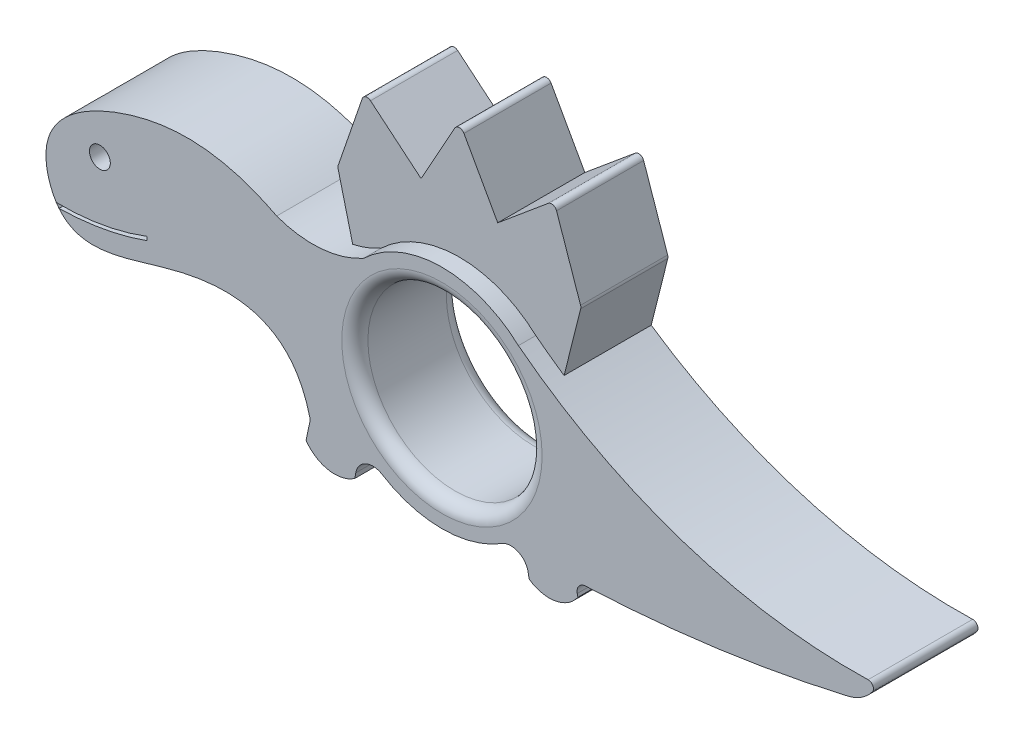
ISO-10303-21;
HEADER;
FILE_DESCRIPTION(('STEP AP214'),'2;1');
FILE_NAME('part.step','',(''),(''),'','','');
FILE_SCHEMA(('AUTOMOTIVE_DESIGN { 1 0 10303 214 1 1 1 1 }'));
ENDSEC;
DATA;
#1=APPLICATION_CONTEXT('core data for automotive mechanical design processes');
#2=APPLICATION_PROTOCOL_DEFINITION('international standard','automotive_design',2000,#1);
#3=PRODUCT_CONTEXT('',#1,'mechanical');
#4=PRODUCT('Part','Part','',(#3));
#5=PRODUCT_RELATED_PRODUCT_CATEGORY('part','',(#4));
#6=PRODUCT_DEFINITION_FORMATION('','',#4);
#7=PRODUCT_DEFINITION_CONTEXT('part definition',#1,'design');
#8=PRODUCT_DEFINITION('design','',#6,#7);
#9=PRODUCT_DEFINITION_SHAPE('','',#8);
#10=(LENGTH_UNIT() NAMED_UNIT(*) SI_UNIT(.MILLI.,.METRE.));
#11=(NAMED_UNIT(*) PLANE_ANGLE_UNIT() SI_UNIT($,.RADIAN.));
#12=(NAMED_UNIT(*) SI_UNIT($,.STERADIAN.) SOLID_ANGLE_UNIT());
#13=UNCERTAINTY_MEASURE_WITH_UNIT(LENGTH_MEASURE(1.E-05),#10,'distance_accuracy_value','');
#14=(GEOMETRIC_REPRESENTATION_CONTEXT(3) GLOBAL_UNCERTAINTY_ASSIGNED_CONTEXT((#13)) GLOBAL_UNIT_ASSIGNED_CONTEXT((#10,
#11,#12)) REPRESENTATION_CONTEXT('',''));
#15=CARTESIAN_POINT('',(0.,0.,0.));
#16=DIRECTION('',(0.,0.,1.));
#17=DIRECTION('',(1.,0.,0.));
#18=AXIS2_PLACEMENT_3D('',#15,#16,#17);
#19=CARTESIAN_POINT('',(44.302789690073,4.1459824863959,15.24));
#20=CARTESIAN_POINT('',(41.9442858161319,14.3166221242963,15.24));
#21=CARTESIAN_POINT('',(28.2932880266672,16.2579228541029,15.24));
#22=CARTESIAN_POINT('',(8.65452919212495,6.95460847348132,15.24));
#23=CARTESIAN_POINT('',(3.62291857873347,22.6567163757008,15.24));
#24=CARTESIAN_POINT('',(20.2431594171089,32.285139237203,15.24));
#25=CARTESIAN_POINT('',(32.1271786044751,31.1940018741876,15.24));
#26=CARTESIAN_POINT('',(39.4087750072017,27.432,15.24));
#27=B_SPLINE_CURVE_WITH_KNOTS('',3,(#19,#20,#21,#22,#23,#24,#25,#26),.UNSPECIFIED.,.F.,.F.,(4,1,
1,1,1,4),(0.,0.277535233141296,0.472765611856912,0.559772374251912,0.733689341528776,1.),.UNSPECIFIED.);
#28=DIRECTION('',(0.,0.,-1.));
#29=VECTOR('',#28,1.);
#30=SURFACE_OF_LINEAR_EXTRUSION('',#27,#29);
#31=DIRECTION('',(0.,0.,1.));
#32=VECTOR('',#31,1.);
#33=CARTESIAN_POINT('',(7.6788210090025,12.5323780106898,-10.16));
#34=LINE('',#33,#32);
#35=CARTESIAN_POINT('',(7.6788210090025,12.5323780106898,0.));
#36=VERTEX_POINT('',#35);
#37=CARTESIAN_POINT('',(7.6788210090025,12.5323780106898,15.24));
#38=VERTEX_POINT('',#37);
#39=EDGE_CURVE('E79',#36,#38,#34,.T.);
#40=ORIENTED_EDGE('',*,*,#39,.F.);
#41=CARTESIAN_POINT('',(44.302789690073,4.1459824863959,0.));
#42=CARTESIAN_POINT('',(41.9442858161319,14.3166221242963,0.));
#43=CARTESIAN_POINT('',(28.2932880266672,16.2579228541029,0.));
#44=CARTESIAN_POINT('',(8.65452919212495,6.95460847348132,0.));
#45=CARTESIAN_POINT('',(3.62291857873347,22.6567163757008,0.));
#46=CARTESIAN_POINT('',(20.2431594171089,32.285139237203,0.));
#47=CARTESIAN_POINT('',(32.1271786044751,31.1940018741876,0.));
#48=CARTESIAN_POINT('',(39.4087750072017,27.432,0.));
#49=B_SPLINE_CURVE_WITH_KNOTS('',3,(#41,#42,#43,#44,#45,#46,#47,#48),.UNSPECIFIED.,.F.,.F.,(4,1,
1,1,1,4),(0.,0.277535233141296,0.472765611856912,0.559772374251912,0.733689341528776,1.),.UNSPECIFIED.);
#50=CARTESIAN_POINT('',(44.2339905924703,4.43362668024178,0.));
#51=VERTEX_POINT('',#50);
#52=EDGE_CURVE('E426',#51,#36,#49,.T.);
#53=ORIENTED_EDGE('',*,*,#52,.F.);
#54=DIRECTION('',(0.,0.,-1.));
#55=VECTOR('',#54,1.);
#56=CARTESIAN_POINT('',(44.2339905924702,4.43362668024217,0.));
#57=LINE('',#56,#55);
#58=CARTESIAN_POINT('',(44.2339905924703,4.43362668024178,15.24));
#59=VERTEX_POINT('',#58);
#60=EDGE_CURVE('E425',#51,#59,#57,.F.);
#61=ORIENTED_EDGE('',*,*,#60,.T.);
#62=EDGE_CURVE('E420',#59,#38,#27,.T.);
#63=ORIENTED_EDGE('',*,*,#62,.T.);
#64=EDGE_LOOP('',(#40,#53,#61,#63));
#65=FACE_BOUND('',#64,.T.);
#66=ADVANCED_FACE('F68',(#65),#30,.T.);
#67=CARTESIAN_POINT('',(0.,0.,15.24));
#68=DIRECTION('',(0.,0.,1.));
#69=DIRECTION('',(1.,0.,0.));
#70=AXIS2_PLACEMENT_3D('',#67,#68,#69);
#71=PLANE('',#70);
#72=CARTESIAN_POINT('',(13.6336982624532,21.9726557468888,15.24));
#73=DIRECTION('',(0.,0.,1.));
#74=DIRECTION('',(1.,0.,0.));
#75=AXIS2_PLACEMENT_3D('',#72,#73,#74);
#76=CIRCLE('',#75,1.52069340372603);
#77=CARTESIAN_POINT('',(15.1543916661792,21.9726557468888,15.24));
#78=VERTEX_POINT('',#77);
#79=EDGE_CURVE('E691',#78,#78,#76,.T.);
#80=ORIENTED_EDGE('',*,*,#79,.F.);
#81=EDGE_LOOP('',(#80));
#82=FACE_BOUND('',#81,.T.);
#83=CARTESIAN_POINT('',(63.5,16.51,15.24));
#84=DIRECTION('',(0.,0.,1.));
#85=DIRECTION('',(1.,0.,0.));
#86=AXIS2_PLACEMENT_3D('',#83,#84,#85);
#87=CIRCLE('',#86,14.605);
#88=CARTESIAN_POINT('',(78.105,16.51,15.24));
#89=VERTEX_POINT('',#88);
#90=EDGE_CURVE('E419',#89,#89,#87,.F.);
#91=ORIENTED_EDGE('',*,*,#90,.T.);
#92=EDGE_LOOP('',(#91));
#93=FACE_BOUND('',#92,.T.);
#94=CARTESIAN_POINT('',(7.28369807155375,13.0826560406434,15.24));
#95=VERTEX_POINT('',#94);
#96=CARTESIAN_POINT('',(39.4087750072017,27.432,15.24));
#97=VERTEX_POINT('',#96);
#98=EDGE_CURVE('E407',#95,#97,#27,.T.);
#99=ORIENTED_EDGE('',*,*,#98,.F.);
#100=CARTESIAN_POINT('',(7.88874022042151,48.3174842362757,15.24));
#101=DIRECTION('',(0.,0.,1.));
#102=DIRECTION('',(1.,0.,0.));
#103=AXIS2_PLACEMENT_3D('',#100,#101,#102);
#104=CIRCLE('',#103,35.2400229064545);
#105=CARTESIAN_POINT('',(20.499396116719,15.4110931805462,15.24));
#106=VERTEX_POINT('',#105);
#107=EDGE_CURVE('E416',#95,#106,#104,.T.);
#108=ORIENTED_EDGE('',*,*,#107,.T.);
#109=DIRECTION('',(0.,1.,0.));
#110=VECTOR('',#109,1.);
#111=CARTESIAN_POINT('',(20.499396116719,0.,15.24));
#112=LINE('',#111,#110);
#113=CARTESIAN_POINT('',(20.499396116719,14.861327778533,15.24));
#114=VERTEX_POINT('',#113);
#115=EDGE_CURVE('E410',#114,#106,#112,.T.);
#116=ORIENTED_EDGE('',*,*,#115,.F.);
#117=CARTESIAN_POINT('',(7.04511570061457,52.4731418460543,15.24));
#118=DIRECTION('',(0.,0.,1.));
#119=DIRECTION('',(1.,0.,0.));
#120=AXIS2_PLACEMENT_3D('',#117,#118,#119);
#121=CIRCLE('',#120,39.945791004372);
#122=EDGE_CURVE('E13',#38,#114,#121,.T.);
#123=ORIENTED_EDGE('',*,*,#122,.F.);
#124=ORIENTED_EDGE('',*,*,#62,.F.);
#125=CARTESIAN_POINT('',(43.0009225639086,4.129581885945,15.24));
#126=DIRECTION('',(0.,0.,1.));
#127=DIRECTION('',(1.,0.,0.));
#128=AXIS2_PLACEMENT_3D('',#125,#126,#127);
#129=CIRCLE('',#128,1.27);
#130=CARTESIAN_POINT('',(44.2431623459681,3.86549795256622,15.24));
#131=VERTEX_POINT('',#130);
#132=EDGE_CURVE('E418',#59,#131,#129,.F.);
#133=ORIENTED_EDGE('',*,*,#132,.T.);
#134=DIRECTION('',(0.207940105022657,0.978141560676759,0.));
#135=VECTOR('',#134,1.);
#136=CARTESIAN_POINT('',(41.5439059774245,-8.83169115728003,15.24));
#137=LINE('',#136,#135);
#138=CARTESIAN_POINT('',(43.688,1.25403748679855,15.24));
#139=VERTEX_POINT('',#138);
#140=EDGE_CURVE('E525',#139,#131,#137,.T.);
#141=ORIENTED_EDGE('',*,*,#140,.F.);
#142=CARTESIAN_POINT('',(47.8644882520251,4.1459824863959,15.24));
#143=DIRECTION('',(0.,0.,1.));
#144=DIRECTION('',(1.,0.,0.));
#145=AXIS2_PLACEMENT_3D('',#142,#143,#144);
#146=CIRCLE('',#145,5.08);
#147=CARTESIAN_POINT('',(50.8,0.,15.24));
#148=VERTEX_POINT('',#147);
#149=EDGE_CURVE('E513',#139,#148,#146,.T.);
#150=ORIENTED_EDGE('',*,*,#149,.T.);
#151=DIRECTION('',(-0.173648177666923,-0.984807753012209,0.));
#152=VECTOR('',#151,1.);
#153=CARTESIAN_POINT('',(49.2681925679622,-8.68731164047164,15.24));
#154=LINE('',#153,#152);
#155=CARTESIAN_POINT('',(50.9366787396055,0.775143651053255,15.24));
#156=VERTEX_POINT('',#155);
#157=EDGE_CURVE('E545',#156,#148,#154,.T.);
#158=ORIENTED_EDGE('',*,*,#157,.F.);
#159=CARTESIAN_POINT('',(53.4380904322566,0.334077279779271,15.24));
#160=DIRECTION('',(0.,0.,1.));
#161=DIRECTION('',(1.,0.,0.));
#162=AXIS2_PLACEMENT_3D('',#159,#160,#161);
#163=CIRCLE('',#162,2.54);
#164=CARTESIAN_POINT('',(54.7796783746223,2.4908669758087,15.24));
#165=VERTEX_POINT('',#164);
#166=EDGE_CURVE('E532',#156,#165,#163,.F.);
#167=ORIENTED_EDGE('',*,*,#166,.T.);
#168=CARTESIAN_POINT('',(63.5,16.51,15.24));
#169=DIRECTION('',(0.,0.,1.));
#170=DIRECTION('',(1.,0.,0.));
#171=AXIS2_PLACEMENT_3D('',#168,#169,#170);
#172=CIRCLE('',#171,16.51);
#173=CARTESIAN_POINT('',(72.2203216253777,2.49086697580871,15.24));
#174=VERTEX_POINT('',#173);
#175=EDGE_CURVE('E534',#165,#174,#172,.T.);
#176=ORIENTED_EDGE('',*,*,#175,.T.);
#177=CARTESIAN_POINT('',(73.5619095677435,0.334077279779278,15.24));
#178=DIRECTION('',(0.,0.,1.));
#179=DIRECTION('',(1.,0.,0.));
#180=AXIS2_PLACEMENT_3D('',#177,#178,#179);
#181=CIRCLE('',#180,2.54);
#182=CARTESIAN_POINT('',(76.0633212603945,0.775143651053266,15.24));
#183=VERTEX_POINT('',#182);
#184=EDGE_CURVE('E539',#174,#183,#181,.F.);
#185=ORIENTED_EDGE('',*,*,#184,.T.);
#186=DIRECTION('',(0.173648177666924,-0.984807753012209,0.));
#187=VECTOR('',#186,1.);
#188=CARTESIAN_POINT('',(73.9022888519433,13.0309674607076,15.24));
#189=LINE('',#188,#187);
#190=CARTESIAN_POINT('',(76.2,0.,15.24));
#191=VERTEX_POINT('',#190);
#192=EDGE_CURVE('E541',#183,#191,#189,.T.);
#193=ORIENTED_EDGE('',*,*,#192,.T.);
#194=CARTESIAN_POINT('',(79.1355117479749,4.1459824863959,15.24));
#195=DIRECTION('',(0.,0.,1.));
#196=DIRECTION('',(1.,0.,0.));
#197=AXIS2_PLACEMENT_3D('',#194,#195,#196);
#198=CIRCLE('',#197,5.08);
#199=CARTESIAN_POINT('',(83.312,1.25403748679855,15.24));
#200=VERTEX_POINT('',#199);
#201=EDGE_CURVE('E569',#200,#191,#198,.F.);
#202=ORIENTED_EDGE('',*,*,#201,.F.);
#203=DIRECTION('',(-0.207940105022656,0.97814156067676,0.));
#204=VECTOR('',#203,1.);
#205=CARTESIAN_POINT('',(79.9647299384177,16.9994559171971,15.24));
#206=LINE('',#205,#204);
#207=CARTESIAN_POINT('',(83.2200915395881,1.68637104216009,15.24));
#208=VERTEX_POINT('',#207);
#209=EDGE_CURVE('E517',#200,#208,#206,.T.);
#210=ORIENTED_EDGE('',*,*,#209,.T.);
#211=CARTESIAN_POINT('',(84.4623313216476,1.95045497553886,15.24));
#212=DIRECTION('',(0.,0.,1.));
#213=DIRECTION('',(1.,0.,0.));
#214=AXIS2_PLACEMENT_3D('',#211,#212,#213);
#215=CIRCLE('',#214,1.27);
#216=CARTESIAN_POINT('',(84.406848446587,3.21924244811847,15.24));
#217=VERTEX_POINT('',#216);
#218=EDGE_CURVE('E515',#208,#217,#215,.F.);
#219=ORIENTED_EDGE('',*,*,#218,.T.);
#220=CARTESIAN_POINT('',(75.2519043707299,212.575342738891,15.24));
#221=DIRECTION('',(0.,0.,1.));
#222=DIRECTION('',(1.,0.,0.));
#223=AXIS2_PLACEMENT_3D('',#220,#221,#222);
#224=CIRCLE('',#223,209.55617320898);
#225=CARTESIAN_POINT('',(122.63482217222,8.44634227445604,15.24));
#226=VERTEX_POINT('',#225);
#227=EDGE_CURVE('E478',#217,#226,#224,.T.);
#228=ORIENTED_EDGE('',*,*,#227,.T.);
#229=CARTESIAN_POINT('',(121.199018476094,14.6318873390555,15.24));
#230=DIRECTION('',(0.,0.,1.));
#231=DIRECTION('',(1.,0.,0.));
#232=AXIS2_PLACEMENT_3D('',#229,#230,#231);
#233=CIRCLE('',#232,6.35);
#234=CARTESIAN_POINT('',(126.24426470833,10.7759840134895,15.24));
#235=VERTEX_POINT('',#234);
#236=EDGE_CURVE('E468',#226,#235,#233,.T.);
#237=ORIENTED_EDGE('',*,*,#236,.T.);
#238=CARTESIAN_POINT('',(125.638835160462,11.2386924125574,15.24));
#239=DIRECTION('',(0.,0.,1.));
#240=DIRECTION('',(1.,0.,0.));
#241=AXIS2_PLACEMENT_3D('',#238,#239,#240);
#242=CIRCLE('',#241,0.762);
#243=CARTESIAN_POINT('',(125.618635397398,12.0004246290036,15.24));
#244=VERTEX_POINT('',#243);
#245=EDGE_CURVE('E466',#235,#244,#242,.T.);
#246=ORIENTED_EDGE('',*,*,#245,.T.);
#247=CARTESIAN_POINT('',(123.504393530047,91.7283966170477,15.24));
#248=DIRECTION('',(0.,0.,1.));
#249=DIRECTION('',(1.,0.,0.));
#250=AXIS2_PLACEMENT_3D('',#247,#248,#249);
#251=CIRCLE('',#250,79.756);
#252=CARTESIAN_POINT('',(74.6464757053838,28.6893341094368,15.24));
#253=VERTEX_POINT('',#252);
#254=EDGE_CURVE('E475',#253,#244,#251,.T.);
#255=ORIENTED_EDGE('',*,*,#254,.F.);
#256=CARTESIAN_POINT('',(52.07,28.4236560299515,15.24));
#257=VERTEX_POINT('',#256);
#258=EDGE_CURVE('E453',#253,#257,#172,.T.);
#259=ORIENTED_EDGE('',*,*,#258,.T.);
#260=CARTESIAN_POINT('',(44.6576184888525,41.7395938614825,15.24));
#261=DIRECTION('',(0.,0.,1.));
#262=DIRECTION('',(1.,0.,0.));
#263=AXIS2_PLACEMENT_3D('',#260,#261,#262);
#264=CIRCLE('',#263,15.24);
#265=EDGE_CURVE('E448',#257,#97,#264,.F.);
#266=ORIENTED_EDGE('',*,*,#265,.T.);
#267=EDGE_LOOP('',(#99,#108,#116,#123,#124,#133,#141,#150,#158,#167,#176,#185,#193,#202,#210,
#219,#228,#237,#246,#255,#259,#266));
#268=FACE_BOUND('',#267,.T.);
#269=ADVANCED_FACE('F614',(#82,#93,#268),#71,.T.);
#270=CARTESIAN_POINT('',(0.,0.,0.));
#271=DIRECTION('',(0.,0.,1.));
#272=DIRECTION('',(1.,0.,0.));
#273=AXIS2_PLACEMENT_3D('',#270,#271,#272);
#274=PLANE('',#273);
#275=CARTESIAN_POINT('',(13.6336982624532,21.9726557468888,0.));
#276=DIRECTION('',(0.,0.,1.));
#277=DIRECTION('',(1.,0.,0.));
#278=AXIS2_PLACEMENT_3D('',#275,#276,#277);
#279=CIRCLE('',#278,1.52069340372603);
#280=CARTESIAN_POINT('',(15.1543916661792,21.9726557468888,0.));
#281=VERTEX_POINT('',#280);
#282=EDGE_CURVE('E73',#281,#281,#279,.T.);
#283=ORIENTED_EDGE('',*,*,#282,.T.);
#284=EDGE_LOOP('',(#283));
#285=FACE_BOUND('',#284,.T.);
#286=CARTESIAN_POINT('',(63.5,16.51,0.));
#287=DIRECTION('',(0.,0.,1.));
#288=DIRECTION('',(1.,0.,0.));
#289=AXIS2_PLACEMENT_3D('',#286,#287,#288);
#290=CIRCLE('',#289,14.605);
#291=CARTESIAN_POINT('',(78.105,16.51,0.));
#292=VERTEX_POINT('',#291);
#293=EDGE_CURVE('E443',#292,#292,#290,.T.);
#294=ORIENTED_EDGE('',*,*,#293,.T.);
#295=EDGE_LOOP('',(#294));
#296=FACE_BOUND('',#295,.T.);
#297=CARTESIAN_POINT('',(7.88874022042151,48.3174842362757,0.));
#298=DIRECTION('',(0.,0.,1.));
#299=DIRECTION('',(1.,0.,0.));
#300=AXIS2_PLACEMENT_3D('',#297,#298,#299);
#301=CIRCLE('',#300,35.2400229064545);
#302=CARTESIAN_POINT('',(7.28369807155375,13.0826560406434,0.));
#303=VERTEX_POINT('',#302);
#304=CARTESIAN_POINT('',(20.499396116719,15.4110931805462,0.));
#305=VERTEX_POINT('',#304);
#306=EDGE_CURVE('E414',#303,#305,#301,.T.);
#307=ORIENTED_EDGE('',*,*,#306,.F.);
#308=CARTESIAN_POINT('',(39.4087750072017,27.432,0.));
#309=VERTEX_POINT('',#308);
#310=EDGE_CURVE('E363',#303,#309,#49,.T.);
#311=ORIENTED_EDGE('',*,*,#310,.T.);
#312=CARTESIAN_POINT('',(44.6576184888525,41.7395938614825,0.));
#313=DIRECTION('',(0.,0.,1.));
#314=DIRECTION('',(1.,0.,0.));
#315=AXIS2_PLACEMENT_3D('',#312,#313,#314);
#316=CIRCLE('',#315,15.24);
#317=CARTESIAN_POINT('',(47.9479203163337,26.8590188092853,0.));
#318=VERTEX_POINT('',#317);
#319=EDGE_CURVE('E357',#318,#309,#316,.F.);
#320=ORIENTED_EDGE('',*,*,#319,.F.);
#321=DIRECTION('',(-0.243629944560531,0.969868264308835,0.));
#322=VECTOR('',#321,1.);
#323=CARTESIAN_POINT('',(51.4484345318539,12.9237956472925,0.));
#324=LINE('',#323,#322);
#325=CARTESIAN_POINT('',(45.8174035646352,35.3404088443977,0.));
#326=VERTEX_POINT('',#325);
#327=EDGE_CURVE('E359',#318,#326,#324,.T.);
#328=ORIENTED_EDGE('',*,*,#327,.T.);
#329=CARTESIAN_POINT('',(46.5564431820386,35.5260548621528,0.));
#330=DIRECTION('',(0.,0.,1.));
#331=DIRECTION('',(1.,0.,0.));
#332=AXIS2_PLACEMENT_3D('',#329,#330,#331);
#333=CIRCLE('',#332,0.762);
#334=CARTESIAN_POINT('',(45.8359393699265,35.7740836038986,0.));
#335=VERTEX_POINT('',#334);
#336=EDGE_CURVE('E362',#326,#335,#333,.F.);
#337=ORIENTED_EDGE('',*,*,#336,.T.);
#338=DIRECTION('',(0.325497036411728,0.945543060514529,0.));
#339=VECTOR('',#338,1.);
#340=CARTESIAN_POINT('',(29.9694564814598,-10.3167900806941,0.));
#341=LINE('',#340,#339);
#342=CARTESIAN_POINT('',(49.3373759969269,45.9454791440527,0.));
#343=VERTEX_POINT('',#342);
#344=EDGE_CURVE('E364',#335,#343,#341,.T.);
#345=ORIENTED_EDGE('',*,*,#344,.T.);
#346=CARTESIAN_POINT('',(50.057879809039,45.697450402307,0.));
#347=DIRECTION('',(0.,0.,1.));
#348=DIRECTION('',(1.,0.,0.));
#349=AXIS2_PLACEMENT_3D('',#346,#347,#348);
#350=CIRCLE('',#349,0.762);
#351=CARTESIAN_POINT('',(50.5456471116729,46.2828793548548,0.));
#352=VERTEX_POINT('',#351);
#353=EDGE_CURVE('E367',#343,#352,#350,.F.);
#354=ORIENTED_EDGE('',*,*,#353,.T.);
#355=DIRECTION('',(0.768279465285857,-0.640114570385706,0.));
#356=VECTOR('',#355,1.);
#357=CARTESIAN_POINT('',(43.4722230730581,52.1763100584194,0.));
#358=LINE('',#357,#356);
#359=CARTESIAN_POINT('',(57.912,40.1453863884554,0.));
#360=VERTEX_POINT('',#359);
#361=EDGE_CURVE('E368',#352,#360,#358,.T.);
#362=ORIENTED_EDGE('',*,*,#361,.T.);
#363=DIRECTION('',(0.48707752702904,0.873358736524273,0.));
#364=VECTOR('',#363,1.);
#365=CARTESIAN_POINT('',(27.0951125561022,-15.1111105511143,0.));
#366=LINE('',#365,#364);
#367=CARTESIAN_POINT('',(62.8345006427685,48.9717203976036,0.));
#368=VERTEX_POINT('',#367);
#369=EDGE_CURVE('E370',#360,#368,#366,.T.);
#370=ORIENTED_EDGE('',*,*,#369,.T.);
#371=CARTESIAN_POINT('',(63.5,48.6005673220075,0.));
#372=DIRECTION('',(0.,0.,1.));
#373=DIRECTION('',(1.,0.,0.));
#374=AXIS2_PLACEMENT_3D('',#371,#372,#373);
#375=CIRCLE('',#374,0.762);
#376=CARTESIAN_POINT('',(64.1654993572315,48.9717203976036,0.));
#377=VERTEX_POINT('',#376);
#378=EDGE_CURVE('E373',#368,#377,#375,.F.);
#379=ORIENTED_EDGE('',*,*,#378,.T.);
#380=DIRECTION('',(-0.48707752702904,0.873358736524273,0.));
#381=VECTOR('',#380,1.);
#382=CARTESIAN_POINT('',(69.7748337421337,38.9138529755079,0.));
#383=LINE('',#382,#381);
#384=CARTESIAN_POINT('',(69.088,40.1453863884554,0.));
#385=VERTEX_POINT('',#384);
#386=EDGE_CURVE('E374',#385,#377,#383,.T.);
#387=ORIENTED_EDGE('',*,*,#386,.F.);
#388=DIRECTION('',(-0.768279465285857,-0.640114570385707,0.));
#389=VECTOR('',#388,1.);
#390=CARTESIAN_POINT('',(8.56560315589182,-10.280623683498,0.));
#391=LINE('',#390,#389);
#392=CARTESIAN_POINT('',(76.4543528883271,46.2828793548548,0.));
#393=VERTEX_POINT('',#392);
#394=EDGE_CURVE('E377',#393,#385,#391,.T.);
#395=ORIENTED_EDGE('',*,*,#394,.F.);
#396=CARTESIAN_POINT('',(76.942120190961,45.697450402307,0.));
#397=DIRECTION('',(0.,0.,1.));
#398=DIRECTION('',(1.,0.,0.));
#399=AXIS2_PLACEMENT_3D('',#396,#397,#398);
#400=CIRCLE('',#399,0.762);
#401=CARTESIAN_POINT('',(77.6626240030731,45.9454791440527,0.));
#402=VERTEX_POINT('',#401);
#403=EDGE_CURVE('E505',#393,#402,#400,.F.);
#404=ORIENTED_EDGE('',*,*,#403,.T.);
#405=DIRECTION('',(-0.325497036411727,0.94554306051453,0.));
#406=VECTOR('',#405,1.);
#407=CARTESIAN_POINT('',(83.5751067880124,28.7701858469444,0.));
#408=LINE('',#407,#406);
#409=CARTESIAN_POINT('',(81.1640606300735,35.7740836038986,0.));
#410=VERTEX_POINT('',#409);
#411=EDGE_CURVE('E336',#410,#402,#408,.T.);
#412=ORIENTED_EDGE('',*,*,#411,.F.);
#413=CARTESIAN_POINT('',(80.4435568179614,35.5260548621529,0.));
#414=DIRECTION('',(0.,0.,1.));
#415=DIRECTION('',(1.,0.,0.));
#416=AXIS2_PLACEMENT_3D('',#413,#414,#415);
#417=CIRCLE('',#416,0.762);
#418=CARTESIAN_POINT('',(81.1825964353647,35.3404088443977,0.));
#419=VERTEX_POINT('',#418);
#420=EDGE_CURVE('E382',#410,#419,#417,.F.);
#421=ORIENTED_EDGE('',*,*,#420,.T.);
#422=DIRECTION('',(-0.243629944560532,-0.969868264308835,0.));
#423=VECTOR('',#422,1.);
#424=CARTESIAN_POINT('',(68.013410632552,-17.0849011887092,0.));
#425=LINE('',#424,#423);
#426=CARTESIAN_POINT('',(78.7620840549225,25.7045730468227,0.));
#427=VERTEX_POINT('',#426);
#428=EDGE_CURVE('E380',#419,#427,#425,.T.);
#429=ORIENTED_EDGE('',*,*,#428,.T.);
#430=CARTESIAN_POINT('',(123.504393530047,91.7283966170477,0.));
#431=DIRECTION('',(0.,0.,1.));
#432=DIRECTION('',(1.,0.,0.));
#433=AXIS2_PLACEMENT_3D('',#430,#431,#432);
#434=CIRCLE('',#433,79.756);
#435=CARTESIAN_POINT('',(125.618635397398,12.0004246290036,0.));
#436=VERTEX_POINT('',#435);
#437=EDGE_CURVE('E335',#427,#436,#434,.T.);
#438=ORIENTED_EDGE('',*,*,#437,.T.);
#439=CARTESIAN_POINT('',(125.638835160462,11.2386924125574,0.));
#440=DIRECTION('',(0.,0.,1.));
#441=DIRECTION('',(1.,0.,0.));
#442=AXIS2_PLACEMENT_3D('',#439,#440,#441);
#443=CIRCLE('',#442,0.762);
#444=CARTESIAN_POINT('',(126.24426470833,10.7759840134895,0.));
#445=VERTEX_POINT('',#444);
#446=EDGE_CURVE('E471',#436,#445,#443,.F.);
#447=ORIENTED_EDGE('',*,*,#446,.T.);
#448=CARTESIAN_POINT('',(121.199018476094,14.6318873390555,0.));
#449=DIRECTION('',(0.,0.,1.));
#450=DIRECTION('',(1.,0.,0.));
#451=AXIS2_PLACEMENT_3D('',#448,#449,#450);
#452=CIRCLE('',#451,6.35);
#453=CARTESIAN_POINT('',(122.63482217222,8.44634227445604,0.));
#454=VERTEX_POINT('',#453);
#455=EDGE_CURVE('E473',#445,#454,#452,.F.);
#456=ORIENTED_EDGE('',*,*,#455,.T.);
#457=CARTESIAN_POINT('',(75.2519043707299,212.575342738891,0.));
#458=DIRECTION('',(0.,0.,1.));
#459=DIRECTION('',(1.,0.,0.));
#460=AXIS2_PLACEMENT_3D('',#457,#458,#459);
#461=CIRCLE('',#460,209.55617320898);
#462=CARTESIAN_POINT('',(84.406848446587,3.21924244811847,0.));
#463=VERTEX_POINT('',#462);
#464=EDGE_CURVE('E482',#463,#454,#461,.T.);
#465=ORIENTED_EDGE('',*,*,#464,.F.);
#466=CARTESIAN_POINT('',(84.4623313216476,1.95045497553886,0.));
#467=DIRECTION('',(0.,0.,1.));
#468=DIRECTION('',(1.,0.,0.));
#469=AXIS2_PLACEMENT_3D('',#466,#467,#468);
#470=CIRCLE('',#469,1.27);
#471=CARTESIAN_POINT('',(83.2200915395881,1.68637104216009,0.));
#472=VERTEX_POINT('',#471);
#473=EDGE_CURVE('E484',#463,#472,#470,.T.);
#474=ORIENTED_EDGE('',*,*,#473,.T.);
#475=DIRECTION('',(-0.207940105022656,0.97814156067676,0.));
#476=VECTOR('',#475,1.);
#477=CARTESIAN_POINT('',(79.9647299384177,16.9994559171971,0.));
#478=LINE('',#477,#476);
#479=CARTESIAN_POINT('',(83.312,1.25403748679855,0.));
#480=VERTEX_POINT('',#479);
#481=EDGE_CURVE('E529',#480,#472,#478,.T.);
#482=ORIENTED_EDGE('',*,*,#481,.F.);
#483=CARTESIAN_POINT('',(79.1355117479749,4.1459824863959,0.));
#484=DIRECTION('',(0.,0.,1.));
#485=DIRECTION('',(1.,0.,0.));
#486=AXIS2_PLACEMENT_3D('',#483,#484,#485);
#487=CIRCLE('',#486,5.08);
#488=CARTESIAN_POINT('',(76.2,0.,0.));
#489=VERTEX_POINT('',#488);
#490=EDGE_CURVE('E519',#480,#489,#487,.F.);
#491=ORIENTED_EDGE('',*,*,#490,.T.);
#492=DIRECTION('',(0.173648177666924,-0.984807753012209,0.));
#493=VECTOR('',#492,1.);
#494=CARTESIAN_POINT('',(73.9022888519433,13.0309674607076,0.));
#495=LINE('',#494,#493);
#496=CARTESIAN_POINT('',(76.0633212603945,0.775143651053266,0.));
#497=VERTEX_POINT('',#496);
#498=EDGE_CURVE('E556',#497,#489,#495,.T.);
#499=ORIENTED_EDGE('',*,*,#498,.F.);
#500=CARTESIAN_POINT('',(73.5619095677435,0.334077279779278,0.));
#501=DIRECTION('',(0.,0.,1.));
#502=DIRECTION('',(1.,0.,0.));
#503=AXIS2_PLACEMENT_3D('',#500,#501,#502);
#504=CIRCLE('',#503,2.54);
#505=CARTESIAN_POINT('',(72.2203216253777,2.49086697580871,0.));
#506=VERTEX_POINT('',#505);
#507=EDGE_CURVE('E538',#497,#506,#504,.T.);
#508=ORIENTED_EDGE('',*,*,#507,.T.);
#509=CARTESIAN_POINT('',(63.5,16.51,0.));
#510=DIRECTION('',(0.,0.,1.));
#511=DIRECTION('',(1.,0.,0.));
#512=AXIS2_PLACEMENT_3D('',#509,#510,#511);
#513=CIRCLE('',#512,16.51);
#514=CARTESIAN_POINT('',(54.7796783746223,2.4908669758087,0.));
#515=VERTEX_POINT('',#514);
#516=EDGE_CURVE('E550',#515,#506,#513,.T.);
#517=ORIENTED_EDGE('',*,*,#516,.F.);
#518=CARTESIAN_POINT('',(53.4380904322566,0.334077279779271,0.));
#519=DIRECTION('',(0.,0.,1.));
#520=DIRECTION('',(1.,0.,0.));
#521=AXIS2_PLACEMENT_3D('',#518,#519,#520);
#522=CIRCLE('',#521,2.54);
#523=CARTESIAN_POINT('',(50.9366787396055,0.775143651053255,0.));
#524=VERTEX_POINT('',#523);
#525=EDGE_CURVE('E535',#515,#524,#522,.T.);
#526=ORIENTED_EDGE('',*,*,#525,.T.);
#527=DIRECTION('',(-0.173648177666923,-0.984807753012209,0.));
#528=VECTOR('',#527,1.);
#529=CARTESIAN_POINT('',(49.2681925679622,-8.68731164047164,0.));
#530=LINE('',#529,#528);
#531=CARTESIAN_POINT('',(50.8,0.,0.));
#532=VERTEX_POINT('',#531);
#533=EDGE_CURVE('E537',#524,#532,#530,.T.);
#534=ORIENTED_EDGE('',*,*,#533,.T.);
#535=CARTESIAN_POINT('',(47.8644882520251,4.1459824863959,0.));
#536=DIRECTION('',(0.,0.,1.));
#537=DIRECTION('',(1.,0.,0.));
#538=AXIS2_PLACEMENT_3D('',#535,#536,#537);
#539=CIRCLE('',#538,5.08);
#540=CARTESIAN_POINT('',(43.688,1.25403748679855,0.));
#541=VERTEX_POINT('',#540);
#542=EDGE_CURVE('E524',#541,#532,#539,.T.);
#543=ORIENTED_EDGE('',*,*,#542,.F.);
#544=DIRECTION('',(0.207940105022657,0.978141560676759,0.));
#545=VECTOR('',#544,1.);
#546=CARTESIAN_POINT('',(41.5439059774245,-8.83169115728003,0.));
#547=LINE('',#546,#545);
#548=CARTESIAN_POINT('',(44.2431623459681,3.86549795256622,0.));
#549=VERTEX_POINT('',#548);
#550=EDGE_CURVE('E441',#541,#549,#547,.T.);
#551=ORIENTED_EDGE('',*,*,#550,.T.);
#552=CARTESIAN_POINT('',(43.0009225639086,4.129581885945,0.));
#553=DIRECTION('',(0.,0.,1.));
#554=DIRECTION('',(1.,0.,0.));
#555=AXIS2_PLACEMENT_3D('',#552,#553,#554);
#556=CIRCLE('',#555,1.27);
#557=EDGE_CURVE('E433',#549,#51,#556,.T.);
#558=ORIENTED_EDGE('',*,*,#557,.T.);
#559=ORIENTED_EDGE('',*,*,#52,.T.);
#560=CARTESIAN_POINT('',(7.04511570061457,52.4731418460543,0.));
#561=DIRECTION('',(0.,0.,1.));
#562=DIRECTION('',(1.,0.,0.));
#563=AXIS2_PLACEMENT_3D('',#560,#561,#562);
#564=CIRCLE('',#563,39.945791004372);
#565=CARTESIAN_POINT('',(20.499396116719,14.861327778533,0.));
#566=VERTEX_POINT('',#565);
#567=EDGE_CURVE('E88',#36,#566,#564,.T.);
#568=ORIENTED_EDGE('',*,*,#567,.T.);
#569=DIRECTION('',(0.,1.,0.));
#570=VECTOR('',#569,1.);
#571=CARTESIAN_POINT('',(20.499396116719,0.,0.));
#572=LINE('',#571,#570);
#573=EDGE_CURVE('E439',#566,#305,#572,.T.);
#574=ORIENTED_EDGE('',*,*,#573,.T.);
#575=EDGE_LOOP('',(#307,#311,#320,#328,#337,#345,#354,#362,#370,#379,#387,#395,#404,#412,#421,
#429,#438,#447,#456,#465,#474,#482,#491,#499,#508,#517,#526,#534,#543,#551,#558,#559,#568,#574));
#576=FACE_BOUND('',#575,.T.);
#577=ADVANCED_FACE('F621',(#285,#296,#576),#274,.F.);
#578=CARTESIAN_POINT('',(63.5,16.51,15.24));
#579=DIRECTION('',(0.,0.,-1.));
#580=DIRECTION('',(-1.,0.,0.));
#581=AXIS2_PLACEMENT_3D('',#578,#579,#580);
#582=CYLINDRICAL_SURFACE('',#581,16.51);
#583=DIRECTION('',(0.,0.,-1.));
#584=VECTOR('',#583,1.);
#585=CARTESIAN_POINT('',(74.6464757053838,28.6893341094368,15.24));
#586=LINE('',#585,#584);
#587=CARTESIAN_POINT('',(74.6464757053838,28.6893341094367,12.7));
#588=VERTEX_POINT('',#587);
#589=EDGE_CURVE('E571',#253,#588,#586,.T.);
#590=ORIENTED_EDGE('',*,*,#589,.T.);
#591=CARTESIAN_POINT('',(63.5,16.51,12.7));
#592=DIRECTION('',(0.,0.,1.));
#593=DIRECTION('',(1.,0.,0.));
#594=AXIS2_PLACEMENT_3D('',#591,#592,#593);
#595=CIRCLE('',#594,16.51);
#596=CARTESIAN_POINT('',(52.07,28.4236560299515,12.7));
#597=VERTEX_POINT('',#596);
#598=EDGE_CURVE('E325',#588,#597,#595,.T.);
#599=ORIENTED_EDGE('',*,*,#598,.T.);
#600=DIRECTION('',(0.,0.,-1.));
#601=VECTOR('',#600,1.);
#602=CARTESIAN_POINT('',(52.07,28.4236560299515,15.24));
#603=LINE('',#602,#601);
#604=EDGE_CURVE('E408',#257,#597,#603,.T.);
#605=ORIENTED_EDGE('',*,*,#604,.F.);
#606=ORIENTED_EDGE('',*,*,#258,.F.);
#607=EDGE_LOOP('',(#590,#599,#605,#606));
#608=FACE_BOUND('',#607,.T.);
#609=ADVANCED_FACE('F607',(#608),#582,.T.);
#610=CARTESIAN_POINT('',(44.6576184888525,41.7395938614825,15.24));
#611=DIRECTION('',(0.,0.,-1.));
#612=DIRECTION('',(-1.,0.,0.));
#613=AXIS2_PLACEMENT_3D('',#610,#611,#612);
#614=CYLINDRICAL_SURFACE('',#613,15.24);
#615=CARTESIAN_POINT('',(44.6576184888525,41.7395938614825,12.7));
#616=DIRECTION('',(0.,0.,1.));
#617=DIRECTION('',(1.,0.,0.));
#618=AXIS2_PLACEMENT_3D('',#615,#616,#617);
#619=CIRCLE('',#618,15.24);
#620=CARTESIAN_POINT('',(47.9479203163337,26.8590188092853,12.7));
#621=VERTEX_POINT('',#620);
#622=EDGE_CURVE('E358',#597,#621,#619,.F.);
#623=ORIENTED_EDGE('',*,*,#622,.T.);
#624=DIRECTION('',(0.,0.,-1.));
#625=VECTOR('',#624,1.);
#626=CARTESIAN_POINT('',(47.9479203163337,26.8590188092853,12.7));
#627=LINE('',#626,#625);
#628=EDGE_CURVE('E354',#621,#318,#627,.T.);
#629=ORIENTED_EDGE('',*,*,#628,.T.);
#630=ORIENTED_EDGE('',*,*,#319,.T.);
#631=DIRECTION('',(0.,0.,-1.));
#632=VECTOR('',#631,1.);
#633=CARTESIAN_POINT('',(39.4087750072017,27.432,15.24));
#634=LINE('',#633,#632);
#635=EDGE_CURVE('E559',#97,#309,#634,.T.);
#636=ORIENTED_EDGE('',*,*,#635,.F.);
#637=ORIENTED_EDGE('',*,*,#265,.F.);
#638=ORIENTED_EDGE('',*,*,#604,.T.);
#639=EDGE_LOOP('',(#623,#629,#630,#636,#637,#638));
#640=FACE_BOUND('',#639,.T.);
#641=ADVANCED_FACE('F609',(#640),#614,.F.);
#642=DIRECTION('',(0.,0.,1.));
#643=VECTOR('',#642,1.);
#644=CARTESIAN_POINT('',(7.28369807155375,13.0826560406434,-10.16));
#645=LINE('',#644,#643);
#646=EDGE_CURVE('E112',#303,#95,#645,.T.);
#647=ORIENTED_EDGE('',*,*,#646,.T.);
#648=ORIENTED_EDGE('',*,*,#98,.T.);
#649=ORIENTED_EDGE('',*,*,#635,.T.);
#650=ORIENTED_EDGE('',*,*,#310,.F.);
#651=EDGE_LOOP('',(#647,#648,#649,#650));
#652=FACE_BOUND('',#651,.T.);
#653=ADVANCED_FACE('F70',(#652),#30,.T.);
#654=CARTESIAN_POINT('',(41.5439059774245,-8.83169115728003,15.24));
#655=DIRECTION('',(-0.978141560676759,0.207940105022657,0.));
#656=DIRECTION('',(-0.207940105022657,-0.97814156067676,0.));
#657=AXIS2_PLACEMENT_3D('',#654,#655,#656);
#658=PLANE('',#657);
#659=ORIENTED_EDGE('',*,*,#140,.T.);
#660=DIRECTION('',(0.,0.,1.));
#661=VECTOR('',#660,1.);
#662=CARTESIAN_POINT('',(44.2431623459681,3.86549795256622,0.));
#663=LINE('',#662,#661);
#664=EDGE_CURVE('E521',#131,#549,#663,.F.);
#665=ORIENTED_EDGE('',*,*,#664,.T.);
#666=ORIENTED_EDGE('',*,*,#550,.F.);
#667=DIRECTION('',(0.,0.,-1.));
#668=VECTOR('',#667,1.);
#669=CARTESIAN_POINT('',(43.688,1.25403748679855,15.24));
#670=LINE('',#669,#668);
#671=EDGE_CURVE('E546',#139,#541,#670,.T.);
#672=ORIENTED_EDGE('',*,*,#671,.F.);
#673=EDGE_LOOP('',(#659,#665,#666,#672));
#674=FACE_BOUND('',#673,.T.);
#675=ADVANCED_FACE('F674',(#674),#658,.T.);
#676=CARTESIAN_POINT('',(47.8644882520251,4.1459824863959,15.24));
#677=DIRECTION('',(0.,0.,-1.));
#678=DIRECTION('',(-1.,0.,0.));
#679=AXIS2_PLACEMENT_3D('',#676,#677,#678);
#680=CYLINDRICAL_SURFACE('',#679,5.08);
#681=ORIENTED_EDGE('',*,*,#542,.T.);
#682=DIRECTION('',(0.,0.,-1.));
#683=VECTOR('',#682,1.);
#684=CARTESIAN_POINT('',(50.8,0.,15.24));
#685=LINE('',#684,#683);
#686=EDGE_CURVE('E563',#148,#532,#685,.T.);
#687=ORIENTED_EDGE('',*,*,#686,.F.);
#688=ORIENTED_EDGE('',*,*,#149,.F.);
#689=ORIENTED_EDGE('',*,*,#671,.T.);
#690=EDGE_LOOP('',(#681,#687,#688,#689));
#691=FACE_BOUND('',#690,.T.);
#692=ADVANCED_FACE('F671',(#691),#680,.T.);
#693=CARTESIAN_POINT('',(49.2681925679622,-8.68731164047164,15.24));
#694=DIRECTION('',(0.984807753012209,-0.173648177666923,0.));
#695=DIRECTION('',(0.173648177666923,0.984807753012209,0.));
#696=AXIS2_PLACEMENT_3D('',#693,#694,#695);
#697=PLANE('',#696);
#698=ORIENTED_EDGE('',*,*,#533,.F.);
#699=DIRECTION('',(0.,0.,-1.));
#700=VECTOR('',#699,1.);
#701=CARTESIAN_POINT('',(50.9366787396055,0.775143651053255,15.24));
#702=LINE('',#701,#700);
#703=EDGE_CURVE('E543',#524,#156,#702,.F.);
#704=ORIENTED_EDGE('',*,*,#703,.T.);
#705=ORIENTED_EDGE('',*,*,#157,.T.);
#706=ORIENTED_EDGE('',*,*,#686,.T.);
#707=EDGE_LOOP('',(#698,#704,#705,#706));
#708=FACE_BOUND('',#707,.T.);
#709=ADVANCED_FACE('F667',(#708),#697,.T.);
#710=ORIENTED_EDGE('',*,*,#516,.T.);
#711=DIRECTION('',(0.,0.,-1.));
#712=VECTOR('',#711,1.);
#713=CARTESIAN_POINT('',(72.2203216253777,2.49086697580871,15.24));
#714=LINE('',#713,#712);
#715=EDGE_CURVE('E547',#506,#174,#714,.F.);
#716=ORIENTED_EDGE('',*,*,#715,.T.);
#717=ORIENTED_EDGE('',*,*,#175,.F.);
#718=DIRECTION('',(0.,0.,-1.));
#719=VECTOR('',#718,1.);
#720=CARTESIAN_POINT('',(54.7796783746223,2.4908669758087,15.24));
#721=LINE('',#720,#719);
#722=EDGE_CURVE('E549',#165,#515,#721,.T.);
#723=ORIENTED_EDGE('',*,*,#722,.T.);
#724=EDGE_LOOP('',(#710,#716,#717,#723));
#725=FACE_BOUND('',#724,.T.);
#726=ADVANCED_FACE('F657',(#725),#582,.T.);
#727=CARTESIAN_POINT('',(73.9022888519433,13.0309674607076,15.24));
#728=DIRECTION('',(0.984807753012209,0.173648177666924,0.));
#729=DIRECTION('',(-0.173648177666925,0.984807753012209,0.));
#730=AXIS2_PLACEMENT_3D('',#727,#728,#729);
#731=PLANE('',#730);
#732=ORIENTED_EDGE('',*,*,#192,.F.);
#733=DIRECTION('',(0.,0.,1.));
#734=VECTOR('',#733,1.);
#735=CARTESIAN_POINT('',(76.0633212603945,0.775143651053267,0.));
#736=LINE('',#735,#734);
#737=EDGE_CURVE('E553',#183,#497,#736,.F.);
#738=ORIENTED_EDGE('',*,*,#737,.T.);
#739=ORIENTED_EDGE('',*,*,#498,.T.);
#740=DIRECTION('',(0.,0.,-1.));
#741=VECTOR('',#740,1.);
#742=CARTESIAN_POINT('',(76.2,0.,15.24));
#743=LINE('',#742,#741);
#744=EDGE_CURVE('E566',#191,#489,#743,.T.);
#745=ORIENTED_EDGE('',*,*,#744,.F.);
#746=EDGE_LOOP('',(#732,#738,#739,#745));
#747=FACE_BOUND('',#746,.T.);
#748=ADVANCED_FACE('F648',(#747),#731,.F.);
#749=CARTESIAN_POINT('',(79.1355117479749,4.1459824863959,15.24));
#750=DIRECTION('',(0.,0.,-1.));
#751=DIRECTION('',(-1.,0.,0.));
#752=AXIS2_PLACEMENT_3D('',#749,#750,#751);
#753=CYLINDRICAL_SURFACE('',#752,5.08);
#754=ORIENTED_EDGE('',*,*,#490,.F.);
#755=DIRECTION('',(0.,0.,-1.));
#756=VECTOR('',#755,1.);
#757=CARTESIAN_POINT('',(83.312,1.25403748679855,15.24));
#758=LINE('',#757,#756);
#759=EDGE_CURVE('E528',#200,#480,#758,.T.);
#760=ORIENTED_EDGE('',*,*,#759,.F.);
#761=ORIENTED_EDGE('',*,*,#201,.T.);
#762=ORIENTED_EDGE('',*,*,#744,.T.);
#763=EDGE_LOOP('',(#754,#760,#761,#762));
#764=FACE_BOUND('',#763,.T.);
#765=ADVANCED_FACE('F642',(#764),#753,.T.);
#766=CARTESIAN_POINT('',(79.9647299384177,16.9994559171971,15.24));
#767=DIRECTION('',(-0.97814156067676,-0.207940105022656,0.));
#768=DIRECTION('',(0.207940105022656,-0.97814156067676,0.));
#769=AXIS2_PLACEMENT_3D('',#766,#767,#768);
#770=PLANE('',#769);
#771=ORIENTED_EDGE('',*,*,#481,.T.);
#772=DIRECTION('',(0.,0.,1.));
#773=VECTOR('',#772,1.);
#774=CARTESIAN_POINT('',(83.2200915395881,1.68637104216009,15.24));
#775=LINE('',#774,#773);
#776=EDGE_CURVE('E526',#472,#208,#775,.T.);
#777=ORIENTED_EDGE('',*,*,#776,.T.);
#778=ORIENTED_EDGE('',*,*,#209,.F.);
#779=ORIENTED_EDGE('',*,*,#759,.T.);
#780=EDGE_LOOP('',(#771,#777,#778,#779));
#781=FACE_BOUND('',#780,.T.);
#782=ADVANCED_FACE('F640',(#781),#770,.F.);
#783=CARTESIAN_POINT('',(75.2519043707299,212.575342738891,15.24));
#784=DIRECTION('',(0.,0.,-1.));
#785=DIRECTION('',(-1.,0.,0.));
#786=AXIS2_PLACEMENT_3D('',#783,#784,#785);
#787=CYLINDRICAL_SURFACE('',#786,209.55617320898);
#788=ORIENTED_EDGE('',*,*,#464,.T.);
#789=DIRECTION('',(0.,0.,-1.));
#790=VECTOR('',#789,1.);
#791=CARTESIAN_POINT('',(122.63482217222,8.44634227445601,15.24));
#792=LINE('',#791,#790);
#793=EDGE_CURVE('E479',#454,#226,#792,.F.);
#794=ORIENTED_EDGE('',*,*,#793,.T.);
#795=ORIENTED_EDGE('',*,*,#227,.F.);
#796=DIRECTION('',(0.,0.,-1.));
#797=VECTOR('',#796,1.);
#798=CARTESIAN_POINT('',(84.406848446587,3.21924244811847,15.24));
#799=LINE('',#798,#797);
#800=EDGE_CURVE('E481',#217,#463,#799,.T.);
#801=ORIENTED_EDGE('',*,*,#800,.T.);
#802=EDGE_LOOP('',(#788,#794,#795,#801));
#803=FACE_BOUND('',#802,.T.);
#804=ADVANCED_FACE('F629',(#803),#787,.T.);
#805=CARTESIAN_POINT('',(123.504393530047,91.7283966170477,15.24));
#806=DIRECTION('',(0.,0.,-1.));
#807=DIRECTION('',(-1.,0.,0.));
#808=AXIS2_PLACEMENT_3D('',#805,#806,#807);
#809=CYLINDRICAL_SURFACE('',#808,79.756);
#810=ORIENTED_EDGE('',*,*,#254,.T.);
#811=DIRECTION('',(0.,0.,-1.));
#812=VECTOR('',#811,1.);
#813=CARTESIAN_POINT('',(125.618635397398,12.0004246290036,15.24));
#814=LINE('',#813,#812);
#815=EDGE_CURVE('E463',#244,#436,#814,.T.);
#816=ORIENTED_EDGE('',*,*,#815,.T.);
#817=ORIENTED_EDGE('',*,*,#437,.F.);
#818=DIRECTION('',(0.,0.,-1.));
#819=VECTOR('',#818,1.);
#820=CARTESIAN_POINT('',(78.7620840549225,25.7045730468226,12.7));
#821=LINE('',#820,#819);
#822=CARTESIAN_POINT('',(78.7620840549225,25.7045730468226,12.7));
#823=VERTEX_POINT('',#822);
#824=EDGE_CURVE('E313',#823,#427,#821,.T.);
#825=ORIENTED_EDGE('',*,*,#824,.F.);
#826=CARTESIAN_POINT('',(123.504393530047,91.7283966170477,12.7));
#827=DIRECTION('',(0.,0.,1.));
#828=DIRECTION('',(1.,0.,0.));
#829=AXIS2_PLACEMENT_3D('',#826,#827,#828);
#830=CIRCLE('',#829,79.756);
#831=EDGE_CURVE('E321',#588,#823,#830,.T.);
#832=ORIENTED_EDGE('',*,*,#831,.F.);
#833=ORIENTED_EDGE('',*,*,#589,.F.);
#834=EDGE_LOOP('',(#810,#816,#817,#825,#832,#833));
#835=FACE_BOUND('',#834,.T.);
#836=ADVANCED_FACE('F332',(#835),#809,.F.);
#837=CARTESIAN_POINT('',(63.5,16.51,15.24));
#838=DIRECTION('',(0.,0.,-1.));
#839=DIRECTION('',(-1.,0.,0.));
#840=AXIS2_PLACEMENT_3D('',#837,#838,#839);
#841=CYLINDRICAL_SURFACE('',#840,12.7);
#842=CARTESIAN_POINT('',(63.5,16.51,13.335));
#843=DIRECTION('',(0.,0.,1.));
#844=DIRECTION('',(1.,0.,0.));
#845=AXIS2_PLACEMENT_3D('',#842,#843,#844);
#846=CIRCLE('',#845,12.7);
#847=CARTESIAN_POINT('',(50.8,16.51,13.335));
#848=VERTEX_POINT('',#847);
#849=EDGE_CURVE('E459',#848,#848,#846,.T.);
#850=CARTESIAN_POINT('',(63.5,16.51,1.905));
#851=DIRECTION('',(0.,0.,1.));
#852=DIRECTION('',(1.,0.,0.));
#853=AXIS2_PLACEMENT_3D('',#850,#851,#852);
#854=CIRCLE('',#853,12.7);
#855=CARTESIAN_POINT('',(50.8,16.51,1.905));
#856=VERTEX_POINT('',#855);
#857=EDGE_CURVE('E462',#856,#856,#854,.F.);
#858=CARTESIAN_POINT('',(50.8,16.51,13.335));
#859=CARTESIAN_POINT('',(50.8,16.51,13.2159375));
#860=CARTESIAN_POINT('',(50.8,16.51,13.096875));
#861=CARTESIAN_POINT('',(50.8,16.51,12.85875));
#862=CARTESIAN_POINT('',(50.8,16.51,12.7396875));
#863=CARTESIAN_POINT('',(50.8,16.51,12.5015625));
#864=CARTESIAN_POINT('',(50.8,16.51,12.3825));
#865=CARTESIAN_POINT('',(50.8,16.51,12.144375));
#866=CARTESIAN_POINT('',(50.8,16.51,12.0253125));
#867=CARTESIAN_POINT('',(50.8,16.51,11.7871875));
#868=CARTESIAN_POINT('',(50.8,16.51,11.668125));
#869=CARTESIAN_POINT('',(50.8,16.51,11.43));
#870=CARTESIAN_POINT('',(50.8,16.51,11.3109375));
#871=CARTESIAN_POINT('',(50.8,16.51,11.0728125));
#872=CARTESIAN_POINT('',(50.8,16.51,10.95375));
#873=CARTESIAN_POINT('',(50.8,16.51,10.715625));
#874=CARTESIAN_POINT('',(50.8,16.51,10.5965625));
#875=CARTESIAN_POINT('',(50.8,16.51,10.3584375));
#876=CARTESIAN_POINT('',(50.8,16.51,10.239375));
#877=CARTESIAN_POINT('',(50.8,16.51,10.00125));
#878=CARTESIAN_POINT('',(50.8,16.51,9.8821875));
#879=CARTESIAN_POINT('',(50.8,16.51,9.6440625));
#880=CARTESIAN_POINT('',(50.8,16.51,9.525));
#881=CARTESIAN_POINT('',(50.8,16.51,9.286875));
#882=CARTESIAN_POINT('',(50.8,16.51,9.1678125));
#883=CARTESIAN_POINT('',(50.8,16.51,8.9296875));
#884=CARTESIAN_POINT('',(50.8,16.51,8.810625));
#885=CARTESIAN_POINT('',(50.8,16.51,8.5725));
#886=CARTESIAN_POINT('',(50.8,16.51,8.4534375));
#887=CARTESIAN_POINT('',(50.8,16.51,8.2153125));
#888=CARTESIAN_POINT('',(50.8,16.51,8.09625));
#889=CARTESIAN_POINT('',(50.8,16.51,7.858125));
#890=CARTESIAN_POINT('',(50.8,16.51,7.7390625));
#891=CARTESIAN_POINT('',(50.8,16.51,7.5009375));
#892=CARTESIAN_POINT('',(50.8,16.51,7.381875));
#893=CARTESIAN_POINT('',(50.8,16.51,7.14375));
#894=CARTESIAN_POINT('',(50.8,16.51,7.0246875));
#895=CARTESIAN_POINT('',(50.8,16.51,6.7865625));
#896=CARTESIAN_POINT('',(50.8,16.51,6.6675));
#897=CARTESIAN_POINT('',(50.8,16.51,6.429375));
#898=CARTESIAN_POINT('',(50.8,16.51,6.3103125));
#899=CARTESIAN_POINT('',(50.8,16.51,6.0721875));
#900=CARTESIAN_POINT('',(50.8,16.51,5.953125));
#901=CARTESIAN_POINT('',(50.8,16.51,5.715));
#902=CARTESIAN_POINT('',(50.8,16.51,5.5959375));
#903=CARTESIAN_POINT('',(50.8,16.51,5.3578125));
#904=CARTESIAN_POINT('',(50.8,16.51,5.23875));
#905=CARTESIAN_POINT('',(50.8,16.51,5.000625));
#906=CARTESIAN_POINT('',(50.8,16.51,4.8815625));
#907=CARTESIAN_POINT('',(50.8,16.51,4.6434375));
#908=CARTESIAN_POINT('',(50.8,16.51,4.524375));
#909=CARTESIAN_POINT('',(50.8,16.51,4.28625));
#910=CARTESIAN_POINT('',(50.8,16.51,4.1671875));
#911=CARTESIAN_POINT('',(50.8,16.51,3.9290625));
#912=CARTESIAN_POINT('',(50.8,16.51,3.81));
#913=CARTESIAN_POINT('',(50.8,16.51,3.571875));
#914=CARTESIAN_POINT('',(50.8,16.51,3.4528125));
#915=CARTESIAN_POINT('',(50.8,16.51,3.2146875));
#916=CARTESIAN_POINT('',(50.8,16.51,3.095625));
#917=CARTESIAN_POINT('',(50.8,16.51,2.8575));
#918=CARTESIAN_POINT('',(50.8,16.51,2.7384375));
#919=CARTESIAN_POINT('',(50.8,16.51,2.5003125));
#920=CARTESIAN_POINT('',(50.8,16.51,2.38125));
#921=CARTESIAN_POINT('',(50.8,16.51,2.143125));
#922=CARTESIAN_POINT('',(50.8,16.51,2.0240625));
#923=CARTESIAN_POINT('',(50.8,16.51,1.905));
#924=B_SPLINE_CURVE_WITH_KNOTS('',3,(#858,#859,#860,#861,#862,#863,#864,#865,#866,#867,#868,
#869,#870,#871,#872,#873,#874,#875,#876,#877,#878,#879,#880,#881,#882,#883,#884,#885,#886,#887,
#888,#889,#890,#891,#892,#893,#894,#895,#896,#897,#898,#899,#900,#901,#902,#903,#904,#905,#906,
#907,#908,#909,#910,#911,#912,#913,#914,#915,#916,#917,#918,#919,#920,#921,#922,#923),
.UNSPECIFIED.,.F.,.F.,(4,2,2,2,2,2,2,2,2,2,2,2,2,2,2,2,2,2,2,2,2,2,2,2,2,2,2,2,2,2,2,2,4),(0.,
0.3571875,0.714375,1.0715625,1.42875,1.7859375,2.143125,2.5003125,2.8575,3.2146875,3.571875,
3.9290625,4.28625,4.6434375,5.000625,5.3578125,5.715,6.0721875,6.429375,6.7865625,7.14375,
7.5009375,7.858125,8.2153125,8.5725,8.9296875,9.286875,9.6440625,10.00125,10.3584375,10.715625,
11.0728125,11.43),.UNSPECIFIED.);
#925=EDGE_CURVE('BSEAM743',#848,#856,#924,.T.);
#926=ORIENTED_EDGE('',*,*,#849,.T.);
#927=ORIENTED_EDGE('',*,*,#857,.T.);
#928=ORIENTED_EDGE('',*,*,#925,.T.);
#929=ORIENTED_EDGE('',*,*,#925,.F.);
#930=EDGE_LOOP('',(#926,#928,#927,#929));
#931=FACE_BOUND('',#930,.T.);
#932=ADVANCED_FACE('F743',(#931),#841,.F.);
#933=CARTESIAN_POINT('',(73.5619095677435,0.334077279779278,15.24));
#934=DIRECTION('',(0.,0.,-1.));
#935=DIRECTION('',(-1.,0.,0.));
#936=AXIS2_PLACEMENT_3D('',#933,#934,#935);
#937=CYLINDRICAL_SURFACE('',#936,2.54);
#938=ORIENTED_EDGE('',*,*,#184,.F.);
#939=ORIENTED_EDGE('',*,*,#715,.F.);
#940=ORIENTED_EDGE('',*,*,#507,.F.);
#941=ORIENTED_EDGE('',*,*,#737,.F.);
#942=EDGE_LOOP('',(#938,#939,#940,#941));
#943=FACE_BOUND('',#942,.T.);
#944=ADVANCED_FACE('F652',(#943),#937,.F.);
#945=CARTESIAN_POINT('',(53.4380904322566,0.334077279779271,15.24));
#946=DIRECTION('',(0.,0.,-1.));
#947=DIRECTION('',(-1.,0.,0.));
#948=AXIS2_PLACEMENT_3D('',#945,#946,#947);
#949=CYLINDRICAL_SURFACE('',#948,2.54);
#950=ORIENTED_EDGE('',*,*,#166,.F.);
#951=ORIENTED_EDGE('',*,*,#703,.F.);
#952=ORIENTED_EDGE('',*,*,#525,.F.);
#953=ORIENTED_EDGE('',*,*,#722,.F.);
#954=EDGE_LOOP('',(#950,#951,#952,#953));
#955=FACE_BOUND('',#954,.T.);
#956=ADVANCED_FACE('F663',(#955),#949,.F.);
#957=CARTESIAN_POINT('',(84.4623313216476,1.95045497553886,15.24));
#958=DIRECTION('',(0.,0.,-1.));
#959=DIRECTION('',(-1.,0.,0.));
#960=AXIS2_PLACEMENT_3D('',#957,#958,#959);
#961=CYLINDRICAL_SURFACE('',#960,1.27);
#962=ORIENTED_EDGE('',*,*,#218,.F.);
#963=ORIENTED_EDGE('',*,*,#776,.F.);
#964=ORIENTED_EDGE('',*,*,#473,.F.);
#965=ORIENTED_EDGE('',*,*,#800,.F.);
#966=EDGE_LOOP('',(#962,#963,#964,#965));
#967=FACE_BOUND('',#966,.T.);
#968=ADVANCED_FACE('F636',(#967),#961,.F.);
#969=CARTESIAN_POINT('',(43.0009225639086,4.129581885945,7.61999999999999));
#970=DIRECTION('',(0.,0.,-1.));
#971=DIRECTION('',(-1.,0.,0.));
#972=AXIS2_PLACEMENT_3D('',#969,#970,#971);
#973=CYLINDRICAL_SURFACE('',#972,1.27);
#974=ORIENTED_EDGE('',*,*,#132,.F.);
#975=ORIENTED_EDGE('',*,*,#60,.F.);
#976=ORIENTED_EDGE('',*,*,#557,.F.);
#977=ORIENTED_EDGE('',*,*,#664,.F.);
#978=EDGE_LOOP('',(#974,#975,#976,#977));
#979=FACE_BOUND('',#978,.T.);
#980=ADVANCED_FACE('F679',(#979),#973,.F.);
#981=CARTESIAN_POINT('',(68.013410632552,-17.0849011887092,12.7));
#982=DIRECTION('',(0.969868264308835,-0.243629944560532,0.));
#983=DIRECTION('',(0.243629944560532,0.969868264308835,0.));
#984=AXIS2_PLACEMENT_3D('',#981,#982,#983);
#985=PLANE('',#984);
#986=ORIENTED_EDGE('',*,*,#428,.F.);
#987=DIRECTION('',(0.,0.,-1.));
#988=VECTOR('',#987,1.);
#989=CARTESIAN_POINT('',(81.1825964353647,35.3404088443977,12.7));
#990=LINE('',#989,#988);
#991=CARTESIAN_POINT('',(81.1825964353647,35.3404088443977,12.7));
#992=VERTEX_POINT('',#991);
#993=EDGE_CURVE('E316',#419,#992,#990,.F.);
#994=ORIENTED_EDGE('',*,*,#993,.T.);
#995=DIRECTION('',(-0.243629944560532,-0.969868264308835,0.));
#996=VECTOR('',#995,1.);
#997=CARTESIAN_POINT('',(68.013410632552,-17.0849011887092,12.7));
#998=LINE('',#997,#996);
#999=EDGE_CURVE('E308',#992,#823,#998,.T.);
#1000=ORIENTED_EDGE('',*,*,#999,.T.);
#1001=ORIENTED_EDGE('',*,*,#824,.T.);
#1002=EDGE_LOOP('',(#986,#994,#1000,#1001));
#1003=FACE_BOUND('',#1002,.T.);
#1004=ADVANCED_FACE('F311',(#1003),#985,.T.);
#1005=CARTESIAN_POINT('',(83.5751067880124,28.7701858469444,12.7));
#1006=DIRECTION('',(-0.945543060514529,-0.325497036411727,0.));
#1007=DIRECTION('',(0.325497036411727,-0.945543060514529,0.));
#1008=AXIS2_PLACEMENT_3D('',#1005,#1006,#1007);
#1009=PLANE('',#1008);
#1010=ORIENTED_EDGE('',*,*,#411,.T.);
#1011=DIRECTION('',(0.,0.,-1.));
#1012=VECTOR('',#1011,1.);
#1013=CARTESIAN_POINT('',(77.6626240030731,45.9454791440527,12.7));
#1014=LINE('',#1013,#1012);
#1015=CARTESIAN_POINT('',(77.6626240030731,45.9454791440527,12.7));
#1016=VERTEX_POINT('',#1015);
#1017=EDGE_CURVE('E339',#402,#1016,#1014,.F.);
#1018=ORIENTED_EDGE('',*,*,#1017,.T.);
#1019=DIRECTION('',(-0.325497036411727,0.94554306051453,0.));
#1020=VECTOR('',#1019,1.);
#1021=CARTESIAN_POINT('',(83.5751067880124,28.7701858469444,12.7));
#1022=LINE('',#1021,#1020);
#1023=CARTESIAN_POINT('',(81.1640606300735,35.7740836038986,12.7));
#1024=VERTEX_POINT('',#1023);
#1025=EDGE_CURVE('E403',#1024,#1016,#1022,.T.);
#1026=ORIENTED_EDGE('',*,*,#1025,.F.);
#1027=DIRECTION('',(0.,0.,-1.));
#1028=VECTOR('',#1027,1.);
#1029=CARTESIAN_POINT('',(81.1640606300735,35.7740836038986,0.));
#1030=LINE('',#1029,#1028);
#1031=EDGE_CURVE('E493',#1024,#410,#1030,.T.);
#1032=ORIENTED_EDGE('',*,*,#1031,.T.);
#1033=EDGE_LOOP('',(#1010,#1018,#1026,#1032));
#1034=FACE_BOUND('',#1033,.T.);
#1035=ADVANCED_FACE('F749',(#1034),#1009,.F.);
#1036=CARTESIAN_POINT('',(8.56560315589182,-10.280623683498,12.7));
#1037=DIRECTION('',(0.640114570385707,-0.768279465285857,0.));
#1038=DIRECTION('',(0.768279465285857,0.640114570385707,0.));
#1039=AXIS2_PLACEMENT_3D('',#1036,#1037,#1038);
#1040=PLANE('',#1039);
#1041=DIRECTION('',(-0.768279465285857,-0.640114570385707,0.));
#1042=VECTOR('',#1041,1.);
#1043=CARTESIAN_POINT('',(8.56560315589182,-10.280623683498,12.7));
#1044=LINE('',#1043,#1042);
#1045=CARTESIAN_POINT('',(76.4543528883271,46.2828793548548,12.7));
#1046=VERTEX_POINT('',#1045);
#1047=CARTESIAN_POINT('',(69.088,40.1453863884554,12.7));
#1048=VERTEX_POINT('',#1047);
#1049=EDGE_CURVE('E400',#1046,#1048,#1044,.T.);
#1050=ORIENTED_EDGE('',*,*,#1049,.F.);
#1051=DIRECTION('',(0.,0.,-1.));
#1052=VECTOR('',#1051,1.);
#1053=CARTESIAN_POINT('',(76.4543528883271,46.2828793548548,12.7));
#1054=LINE('',#1053,#1052);
#1055=EDGE_CURVE('E378',#1046,#393,#1054,.T.);
#1056=ORIENTED_EDGE('',*,*,#1055,.T.);
#1057=ORIENTED_EDGE('',*,*,#394,.T.);
#1058=DIRECTION('',(0.,0.,-1.));
#1059=VECTOR('',#1058,1.);
#1060=CARTESIAN_POINT('',(69.088,40.1453863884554,12.7));
#1061=LINE('',#1060,#1059);
#1062=EDGE_CURVE('E344',#1048,#385,#1061,.T.);
#1063=ORIENTED_EDGE('',*,*,#1062,.F.);
#1064=EDGE_LOOP('',(#1050,#1056,#1057,#1063));
#1065=FACE_BOUND('',#1064,.T.);
#1066=ADVANCED_FACE('F752',(#1065),#1040,.F.);
#1067=CARTESIAN_POINT('',(69.7748337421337,38.9138529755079,12.7));
#1068=DIRECTION('',(-0.873358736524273,-0.48707752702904,0.));
#1069=DIRECTION('',(0.48707752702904,-0.873358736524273,0.));
#1070=AXIS2_PLACEMENT_3D('',#1067,#1068,#1069);
#1071=PLANE('',#1070);
#1072=ORIENTED_EDGE('',*,*,#386,.T.);
#1073=DIRECTION('',(0.,0.,-1.));
#1074=VECTOR('',#1073,1.);
#1075=CARTESIAN_POINT('',(64.1654993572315,48.9717203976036,12.7));
#1076=LINE('',#1075,#1074);
#1077=CARTESIAN_POINT('',(64.1654993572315,48.9717203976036,12.7));
#1078=VERTEX_POINT('',#1077);
#1079=EDGE_CURVE('E348',#377,#1078,#1076,.F.);
#1080=ORIENTED_EDGE('',*,*,#1079,.T.);
#1081=DIRECTION('',(-0.48707752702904,0.873358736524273,0.));
#1082=VECTOR('',#1081,1.);
#1083=CARTESIAN_POINT('',(69.7748337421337,38.9138529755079,12.7));
#1084=LINE('',#1083,#1082);
#1085=EDGE_CURVE('E396',#1048,#1078,#1084,.T.);
#1086=ORIENTED_EDGE('',*,*,#1085,.F.);
#1087=ORIENTED_EDGE('',*,*,#1062,.T.);
#1088=EDGE_LOOP('',(#1072,#1080,#1086,#1087));
#1089=FACE_BOUND('',#1088,.T.);
#1090=ADVANCED_FACE('F756',(#1089),#1071,.F.);
#1091=CARTESIAN_POINT('',(27.0951125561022,-15.1111105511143,12.7));
#1092=DIRECTION('',(-0.873358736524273,0.48707752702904,0.));
#1093=DIRECTION('',(-0.48707752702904,-0.873358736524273,0.));
#1094=AXIS2_PLACEMENT_3D('',#1091,#1092,#1093);
#1095=PLANE('',#1094);
#1096=DIRECTION('',(0.48707752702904,0.873358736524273,0.));
#1097=VECTOR('',#1096,1.);
#1098=CARTESIAN_POINT('',(27.0951125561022,-15.1111105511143,12.7));
#1099=LINE('',#1098,#1097);
#1100=CARTESIAN_POINT('',(57.912,40.1453863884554,12.7));
#1101=VERTEX_POINT('',#1100);
#1102=CARTESIAN_POINT('',(62.8345006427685,48.9717203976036,12.7));
#1103=VERTEX_POINT('',#1102);
#1104=EDGE_CURVE('E347',#1101,#1103,#1099,.T.);
#1105=ORIENTED_EDGE('',*,*,#1104,.T.);
#1106=DIRECTION('',(0.,0.,-1.));
#1107=VECTOR('',#1106,1.);
#1108=CARTESIAN_POINT('',(62.8345006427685,48.9717203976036,0.));
#1109=LINE('',#1108,#1107);
#1110=EDGE_CURVE('E395',#1103,#368,#1109,.T.);
#1111=ORIENTED_EDGE('',*,*,#1110,.T.);
#1112=ORIENTED_EDGE('',*,*,#369,.F.);
#1113=DIRECTION('',(0.,0.,-1.));
#1114=VECTOR('',#1113,1.);
#1115=CARTESIAN_POINT('',(57.912,40.1453863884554,12.7));
#1116=LINE('',#1115,#1114);
#1117=EDGE_CURVE('E349',#1101,#360,#1116,.T.);
#1118=ORIENTED_EDGE('',*,*,#1117,.F.);
#1119=EDGE_LOOP('',(#1105,#1111,#1112,#1118));
#1120=FACE_BOUND('',#1119,.T.);
#1121=ADVANCED_FACE('F760',(#1120),#1095,.T.);
#1122=CARTESIAN_POINT('',(43.4722230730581,52.1763100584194,12.7));
#1123=DIRECTION('',(0.640114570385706,0.768279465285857,0.));
#1124=DIRECTION('',(-0.768279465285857,0.640114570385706,0.));
#1125=AXIS2_PLACEMENT_3D('',#1122,#1123,#1124);
#1126=PLANE('',#1125);
#1127=ORIENTED_EDGE('',*,*,#361,.F.);
#1128=DIRECTION('',(0.,0.,-1.));
#1129=VECTOR('',#1128,1.);
#1130=CARTESIAN_POINT('',(50.5456471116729,46.2828793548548,12.7));
#1131=LINE('',#1130,#1129);
#1132=CARTESIAN_POINT('',(50.5456471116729,46.2828793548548,12.7));
#1133=VERTEX_POINT('',#1132);
#1134=EDGE_CURVE('E392',#352,#1133,#1131,.F.);
#1135=ORIENTED_EDGE('',*,*,#1134,.T.);
#1136=DIRECTION('',(0.768279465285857,-0.640114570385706,0.));
#1137=VECTOR('',#1136,1.);
#1138=CARTESIAN_POINT('',(43.4722230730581,52.1763100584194,12.7));
#1139=LINE('',#1138,#1137);
#1140=EDGE_CURVE('E353',#1133,#1101,#1139,.T.);
#1141=ORIENTED_EDGE('',*,*,#1140,.T.);
#1142=ORIENTED_EDGE('',*,*,#1117,.T.);
#1143=EDGE_LOOP('',(#1127,#1135,#1141,#1142));
#1144=FACE_BOUND('',#1143,.T.);
#1145=ADVANCED_FACE('F764',(#1144),#1126,.T.);
#1146=CARTESIAN_POINT('',(29.9694564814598,-10.3167900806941,12.7));
#1147=DIRECTION('',(-0.945543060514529,0.325497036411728,0.));
#1148=DIRECTION('',(-0.325497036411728,-0.945543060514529,0.));
#1149=AXIS2_PLACEMENT_3D('',#1146,#1147,#1148);
#1150=PLANE('',#1149);
#1151=DIRECTION('',(0.325497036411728,0.945543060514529,0.));
#1152=VECTOR('',#1151,1.);
#1153=CARTESIAN_POINT('',(29.9694564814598,-10.3167900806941,12.7));
#1154=LINE('',#1153,#1152);
#1155=CARTESIAN_POINT('',(45.8359393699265,35.7740836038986,12.7));
#1156=VERTEX_POINT('',#1155);
#1157=CARTESIAN_POINT('',(49.3373759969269,45.9454791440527,12.7));
#1158=VERTEX_POINT('',#1157);
#1159=EDGE_CURVE('E352',#1156,#1158,#1154,.T.);
#1160=ORIENTED_EDGE('',*,*,#1159,.T.);
#1161=DIRECTION('',(0.,0.,-1.));
#1162=VECTOR('',#1161,1.);
#1163=CARTESIAN_POINT('',(49.3373759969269,45.9454791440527,12.7));
#1164=LINE('',#1163,#1162);
#1165=EDGE_CURVE('E390',#1158,#343,#1164,.T.);
#1166=ORIENTED_EDGE('',*,*,#1165,.T.);
#1167=ORIENTED_EDGE('',*,*,#344,.F.);
#1168=DIRECTION('',(0.,0.,-1.));
#1169=VECTOR('',#1168,1.);
#1170=CARTESIAN_POINT('',(45.8359393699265,35.7740836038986,12.7));
#1171=LINE('',#1170,#1169);
#1172=EDGE_CURVE('E387',#335,#1156,#1171,.F.);
#1173=ORIENTED_EDGE('',*,*,#1172,.T.);
#1174=EDGE_LOOP('',(#1160,#1166,#1167,#1173));
#1175=FACE_BOUND('',#1174,.T.);
#1176=ADVANCED_FACE('F768',(#1175),#1150,.T.);
#1177=CARTESIAN_POINT('',(51.4484345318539,12.9237956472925,12.7));
#1178=DIRECTION('',(-0.969868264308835,-0.243629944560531,0.));
#1179=DIRECTION('',(0.243629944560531,-0.969868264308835,0.));
#1180=AXIS2_PLACEMENT_3D('',#1177,#1178,#1179);
#1181=PLANE('',#1180);
#1182=DIRECTION('',(-0.243629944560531,0.969868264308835,0.));
#1183=VECTOR('',#1182,1.);
#1184=CARTESIAN_POINT('',(51.4484345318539,12.9237956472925,12.7));
#1185=LINE('',#1184,#1183);
#1186=CARTESIAN_POINT('',(45.8174035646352,35.3404088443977,12.7));
#1187=VERTEX_POINT('',#1186);
#1188=EDGE_CURVE('E383',#621,#1187,#1185,.T.);
#1189=ORIENTED_EDGE('',*,*,#1188,.T.);
#1190=DIRECTION('',(0.,0.,-1.));
#1191=VECTOR('',#1190,1.);
#1192=CARTESIAN_POINT('',(45.8174035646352,35.3404088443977,12.7));
#1193=LINE('',#1192,#1191);
#1194=EDGE_CURVE('E386',#1187,#326,#1193,.T.);
#1195=ORIENTED_EDGE('',*,*,#1194,.T.);
#1196=ORIENTED_EDGE('',*,*,#327,.F.);
#1197=ORIENTED_EDGE('',*,*,#628,.F.);
#1198=EDGE_LOOP('',(#1189,#1195,#1196,#1197));
#1199=FACE_BOUND('',#1198,.T.);
#1200=ADVANCED_FACE('F772',(#1199),#1181,.T.);
#1201=CARTESIAN_POINT('',(0.,0.,12.7));
#1202=DIRECTION('',(0.,0.,1.));
#1203=DIRECTION('',(1.,0.,0.));
#1204=AXIS2_PLACEMENT_3D('',#1201,#1202,#1203);
#1205=PLANE('',#1204);
#1206=ORIENTED_EDGE('',*,*,#1140,.F.);
#1207=CARTESIAN_POINT('',(50.057879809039,45.697450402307,12.7));
#1208=DIRECTION('',(0.,0.,1.));
#1209=DIRECTION('',(1.,0.,0.));
#1210=AXIS2_PLACEMENT_3D('',#1207,#1208,#1209);
#1211=CIRCLE('',#1210,0.762);
#1212=EDGE_CURVE('E488',#1133,#1158,#1211,.T.);
#1213=ORIENTED_EDGE('',*,*,#1212,.T.);
#1214=ORIENTED_EDGE('',*,*,#1159,.F.);
#1215=CARTESIAN_POINT('',(46.5564431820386,35.5260548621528,12.7));
#1216=DIRECTION('',(0.,0.,1.));
#1217=DIRECTION('',(1.,0.,0.));
#1218=AXIS2_PLACEMENT_3D('',#1215,#1216,#1217);
#1219=CIRCLE('',#1218,0.762);
#1220=EDGE_CURVE('E329',#1156,#1187,#1219,.T.);
#1221=ORIENTED_EDGE('',*,*,#1220,.T.);
#1222=ORIENTED_EDGE('',*,*,#1188,.F.);
#1223=ORIENTED_EDGE('',*,*,#622,.F.);
#1224=ORIENTED_EDGE('',*,*,#598,.F.);
#1225=ORIENTED_EDGE('',*,*,#831,.T.);
#1226=ORIENTED_EDGE('',*,*,#999,.F.);
#1227=CARTESIAN_POINT('',(80.4435568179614,35.5260548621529,12.7));
#1228=DIRECTION('',(0.,0.,1.));
#1229=DIRECTION('',(1.,0.,0.));
#1230=AXIS2_PLACEMENT_3D('',#1227,#1228,#1229);
#1231=CIRCLE('',#1230,0.762);
#1232=EDGE_CURVE('E328',#992,#1024,#1231,.T.);
#1233=ORIENTED_EDGE('',*,*,#1232,.T.);
#1234=ORIENTED_EDGE('',*,*,#1025,.T.);
#1235=CARTESIAN_POINT('',(76.942120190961,45.697450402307,12.7));
#1236=DIRECTION('',(0.,0.,1.));
#1237=DIRECTION('',(1.,0.,0.));
#1238=AXIS2_PLACEMENT_3D('',#1235,#1236,#1237);
#1239=CIRCLE('',#1238,0.762);
#1240=EDGE_CURVE('E402',#1016,#1046,#1239,.T.);
#1241=ORIENTED_EDGE('',*,*,#1240,.T.);
#1242=ORIENTED_EDGE('',*,*,#1049,.T.);
#1243=ORIENTED_EDGE('',*,*,#1085,.T.);
#1244=CARTESIAN_POINT('',(63.5,48.6005673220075,12.7));
#1245=DIRECTION('',(0.,0.,1.));
#1246=DIRECTION('',(1.,0.,0.));
#1247=AXIS2_PLACEMENT_3D('',#1244,#1245,#1246);
#1248=CIRCLE('',#1247,0.762);
#1249=EDGE_CURVE('E399',#1078,#1103,#1248,.T.);
#1250=ORIENTED_EDGE('',*,*,#1249,.T.);
#1251=ORIENTED_EDGE('',*,*,#1104,.F.);
#1252=EDGE_LOOP('',(#1206,#1213,#1214,#1221,#1222,#1223,#1224,#1225,#1226,#1233,#1234,#1241,
#1242,#1243,#1250,#1251));
#1253=FACE_BOUND('',#1252,.T.);
#1254=ADVANCED_FACE('F323',(#1253),#1205,.T.);
#1255=CARTESIAN_POINT('',(50.057879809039,45.697450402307,12.7));
#1256=DIRECTION('',(0.,0.,-1.));
#1257=DIRECTION('',(-1.,0.,0.));
#1258=AXIS2_PLACEMENT_3D('',#1255,#1256,#1257);
#1259=CYLINDRICAL_SURFACE('',#1258,0.762);
#1260=ORIENTED_EDGE('',*,*,#1212,.F.);
#1261=ORIENTED_EDGE('',*,*,#1134,.F.);
#1262=ORIENTED_EDGE('',*,*,#353,.F.);
#1263=ORIENTED_EDGE('',*,*,#1165,.F.);
#1264=EDGE_LOOP('',(#1260,#1261,#1262,#1263));
#1265=FACE_BOUND('',#1264,.T.);
#1266=ADVANCED_FACE('F779',(#1265),#1259,.T.);
#1267=CARTESIAN_POINT('',(76.942120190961,45.697450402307,12.7));
#1268=DIRECTION('',(0.,0.,-1.));
#1269=DIRECTION('',(-1.,0.,0.));
#1270=AXIS2_PLACEMENT_3D('',#1267,#1268,#1269);
#1271=CYLINDRICAL_SURFACE('',#1270,0.762);
#1272=ORIENTED_EDGE('',*,*,#1240,.F.);
#1273=ORIENTED_EDGE('',*,*,#1017,.F.);
#1274=ORIENTED_EDGE('',*,*,#403,.F.);
#1275=ORIENTED_EDGE('',*,*,#1055,.F.);
#1276=EDGE_LOOP('',(#1272,#1273,#1274,#1275));
#1277=FACE_BOUND('',#1276,.T.);
#1278=ADVANCED_FACE('F958',(#1277),#1271,.T.);
#1279=CARTESIAN_POINT('',(63.5,48.6005673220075,12.7));
#1280=DIRECTION('',(0.,0.,1.));
#1281=DIRECTION('',(1.,0.,0.));
#1282=AXIS2_PLACEMENT_3D('',#1279,#1280,#1281);
#1283=CYLINDRICAL_SURFACE('',#1282,0.762);
#1284=ORIENTED_EDGE('',*,*,#1249,.F.);
#1285=ORIENTED_EDGE('',*,*,#1079,.F.);
#1286=ORIENTED_EDGE('',*,*,#378,.F.);
#1287=ORIENTED_EDGE('',*,*,#1110,.F.);
#1288=EDGE_LOOP('',(#1284,#1285,#1286,#1287));
#1289=FACE_BOUND('',#1288,.T.);
#1290=ADVANCED_FACE('F968',(#1289),#1283,.T.);
#1291=CARTESIAN_POINT('',(46.5564431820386,35.5260548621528,12.7));
#1292=DIRECTION('',(0.,0.,-1.));
#1293=DIRECTION('',(-1.,0.,0.));
#1294=AXIS2_PLACEMENT_3D('',#1291,#1292,#1293);
#1295=CYLINDRICAL_SURFACE('',#1294,0.762);
#1296=ORIENTED_EDGE('',*,*,#1220,.F.);
#1297=ORIENTED_EDGE('',*,*,#1172,.F.);
#1298=ORIENTED_EDGE('',*,*,#336,.F.);
#1299=ORIENTED_EDGE('',*,*,#1194,.F.);
#1300=EDGE_LOOP('',(#1296,#1297,#1298,#1299));
#1301=FACE_BOUND('',#1300,.T.);
#1302=ADVANCED_FACE('F978',(#1301),#1295,.T.);
#1303=CARTESIAN_POINT('',(80.4435568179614,35.5260548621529,12.7));
#1304=DIRECTION('',(0.,0.,1.));
#1305=DIRECTION('',(1.,0.,0.));
#1306=AXIS2_PLACEMENT_3D('',#1303,#1304,#1305);
#1307=CYLINDRICAL_SURFACE('',#1306,0.762);
#1308=ORIENTED_EDGE('',*,*,#1232,.F.);
#1309=ORIENTED_EDGE('',*,*,#993,.F.);
#1310=ORIENTED_EDGE('',*,*,#420,.F.);
#1311=ORIENTED_EDGE('',*,*,#1031,.F.);
#1312=EDGE_LOOP('',(#1308,#1309,#1310,#1311));
#1313=FACE_BOUND('',#1312,.T.);
#1314=ADVANCED_FACE('F988',(#1313),#1307,.T.);
#1315=CARTESIAN_POINT('',(121.199018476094,14.6318873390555,15.24));
#1316=DIRECTION('',(0.,0.,1.));
#1317=DIRECTION('',(1.,0.,0.));
#1318=AXIS2_PLACEMENT_3D('',#1315,#1316,#1317);
#1319=CYLINDRICAL_SURFACE('',#1318,6.35);
#1320=ORIENTED_EDGE('',*,*,#455,.F.);
#1321=DIRECTION('',(0.,0.,1.));
#1322=VECTOR('',#1321,1.);
#1323=CARTESIAN_POINT('',(126.24426470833,10.7759840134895,15.24));
#1324=LINE('',#1323,#1322);
#1325=EDGE_CURVE('E469',#445,#235,#1324,.T.);
#1326=ORIENTED_EDGE('',*,*,#1325,.T.);
#1327=ORIENTED_EDGE('',*,*,#236,.F.);
#1328=ORIENTED_EDGE('',*,*,#793,.F.);
#1329=EDGE_LOOP('',(#1320,#1326,#1327,#1328));
#1330=FACE_BOUND('',#1329,.T.);
#1331=ADVANCED_FACE('F625',(#1330),#1319,.T.);
#1332=CARTESIAN_POINT('',(125.638835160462,11.2386924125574,15.24));
#1333=DIRECTION('',(0.,0.,1.));
#1334=DIRECTION('',(1.,0.,0.));
#1335=AXIS2_PLACEMENT_3D('',#1332,#1333,#1334);
#1336=CYLINDRICAL_SURFACE('',#1335,0.762);
#1337=ORIENTED_EDGE('',*,*,#245,.F.);
#1338=ORIENTED_EDGE('',*,*,#1325,.F.);
#1339=ORIENTED_EDGE('',*,*,#446,.F.);
#1340=ORIENTED_EDGE('',*,*,#815,.F.);
#1341=EDGE_LOOP('',(#1337,#1338,#1339,#1340));
#1342=FACE_BOUND('',#1341,.T.);
#1343=ADVANCED_FACE('F618',(#1342),#1336,.T.);
#1344=CARTESIAN_POINT('',(63.5,16.51,13.335));
#1345=DIRECTION('',(0.,0.,1.));
#1346=DIRECTION('',(1.,0.,0.));
#1347=AXIS2_PLACEMENT_3D('',#1344,#1345,#1346);
#1348=TOROIDAL_SURFACE('',#1347,14.605,1.905);
#1349=ORIENTED_EDGE('',*,*,#90,.F.);
#1350=EDGE_LOOP('',(#1349));
#1351=FACE_BOUND('',#1350,.T.);
#1352=ORIENTED_EDGE('',*,*,#849,.F.);
#1353=EDGE_LOOP('',(#1352));
#1354=FACE_BOUND('',#1353,.T.);
#1355=ADVANCED_FACE('F1015',(#1351,#1354),#1348,.T.);
#1356=CARTESIAN_POINT('',(63.5,16.51,1.905));
#1357=DIRECTION('',(0.,0.,1.));
#1358=DIRECTION('',(1.,0.,0.));
#1359=AXIS2_PLACEMENT_3D('',#1356,#1357,#1358);
#1360=TOROIDAL_SURFACE('',#1359,14.605,1.905);
#1361=ORIENTED_EDGE('',*,*,#857,.F.);
#1362=EDGE_LOOP('',(#1361));
#1363=FACE_BOUND('',#1362,.T.);
#1364=ORIENTED_EDGE('',*,*,#293,.F.);
#1365=EDGE_LOOP('',(#1364));
#1366=FACE_BOUND('',#1365,.T.);
#1367=ADVANCED_FACE('F782',(#1363,#1366),#1360,.T.);
#1368=CARTESIAN_POINT('',(7.88874022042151,48.3174842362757,-10.16));
#1369=DIRECTION('',(0.,0.,1.));
#1370=DIRECTION('',(1.,0.,0.));
#1371=AXIS2_PLACEMENT_3D('',#1368,#1369,#1370);
#1372=CYLINDRICAL_SURFACE('',#1371,35.2400229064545);
#1373=ORIENTED_EDGE('',*,*,#306,.T.);
#1374=DIRECTION('',(0.,0.,1.));
#1375=VECTOR('',#1374,1.);
#1376=CARTESIAN_POINT('',(20.499396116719,15.4110931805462,-10.16));
#1377=LINE('',#1376,#1375);
#1378=EDGE_CURVE('E412',#305,#106,#1377,.T.);
#1379=ORIENTED_EDGE('',*,*,#1378,.T.);
#1380=ORIENTED_EDGE('',*,*,#107,.F.);
#1381=ORIENTED_EDGE('',*,*,#646,.F.);
#1382=EDGE_LOOP('',(#1373,#1379,#1380,#1381));
#1383=FACE_BOUND('',#1382,.T.);
#1384=ADVANCED_FACE('F780',(#1383),#1372,.T.);
#1385=CARTESIAN_POINT('',(20.499396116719,0.,-10.16));
#1386=DIRECTION('',(1.,0.,0.));
#1387=DIRECTION('',(0.,0.,-1.));
#1388=AXIS2_PLACEMENT_3D('',#1385,#1386,#1387);
#1389=PLANE('',#1388);
#1390=DIRECTION('',(0.,0.,1.));
#1391=VECTOR('',#1390,1.);
#1392=CARTESIAN_POINT('',(20.499396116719,14.861327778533,-10.16));
#1393=LINE('',#1392,#1391);
#1394=EDGE_CURVE('E104',#566,#114,#1393,.T.);
#1395=ORIENTED_EDGE('',*,*,#1394,.T.);
#1396=ORIENTED_EDGE('',*,*,#115,.T.);
#1397=ORIENTED_EDGE('',*,*,#1378,.F.);
#1398=ORIENTED_EDGE('',*,*,#573,.F.);
#1399=EDGE_LOOP('',(#1395,#1396,#1397,#1398));
#1400=FACE_BOUND('',#1399,.T.);
#1401=ADVANCED_FACE('F687',(#1400),#1389,.F.);
#1402=CARTESIAN_POINT('',(7.04511570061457,52.4731418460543,-10.16));
#1403=DIRECTION('',(0.,0.,1.));
#1404=DIRECTION('',(1.,0.,0.));
#1405=AXIS2_PLACEMENT_3D('',#1402,#1403,#1404);
#1406=CYLINDRICAL_SURFACE('',#1405,39.945791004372);
#1407=ORIENTED_EDGE('',*,*,#39,.T.);
#1408=ORIENTED_EDGE('',*,*,#122,.T.);
#1409=ORIENTED_EDGE('',*,*,#1394,.F.);
#1410=ORIENTED_EDGE('',*,*,#567,.F.);
#1411=EDGE_LOOP('',(#1407,#1408,#1409,#1410));
#1412=FACE_BOUND('',#1411,.T.);
#1413=ADVANCED_FACE('F684',(#1412),#1406,.F.);
#1414=CARTESIAN_POINT('',(13.6336982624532,21.9726557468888,-10.16));
#1415=DIRECTION('',(0.,0.,1.));
#1416=DIRECTION('',(1.,0.,0.));
#1417=AXIS2_PLACEMENT_3D('',#1414,#1415,#1416);
#1418=CYLINDRICAL_SURFACE('',#1417,1.52069340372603);
#1419=ORIENTED_EDGE('',*,*,#79,.T.);
#1420=EDGE_LOOP('',(#1419));
#1421=FACE_BOUND('',#1420,.T.);
#1422=ORIENTED_EDGE('',*,*,#282,.F.);
#1423=EDGE_LOOP('',(#1422));
#1424=FACE_BOUND('',#1423,.T.);
#1425=ADVANCED_FACE('F699',(#1421,#1424),#1418,.F.);
#1426=CLOSED_SHELL('',(#66,#269,#577,#609,#641,#653,#675,#692,#709,#726,#748,#765,#782,#804,
#836,#932,#944,#956,#968,#980,#1004,#1035,#1066,#1090,#1121,#1145,#1176,#1200,#1254,#1266,#1278,
#1290,#1302,#1314,#1331,#1343,#1355,#1367,#1384,#1401,#1413,#1425));
#1427=MANIFOLD_SOLID_BREP('B2',#1426);
#1428=CARTESIAN_POINT('',(0.,0.,0.));
#1429=DIRECTION('',(0.,0.,1.));
#1430=DIRECTION('',(1.,0.,0.));
#1431=AXIS2_PLACEMENT_3D('',#1428,#1429,#1430);
#1432=PLANE('',#1431);
#1433=DIRECTION('',(-0.583257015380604,0.812287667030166,0.));
#1434=VECTOR('',#1433,1.);
#1435=CARTESIAN_POINT('',(11.0040683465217,7.90138804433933,0.));
#1436=LINE('',#1435,#1434);
#1437=CARTESIAN_POINT('',(7.67882100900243,12.5323780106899,0.));
#1438=VERTEX_POINT('',#1437);
#1439=CARTESIAN_POINT('',(7.28369807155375,13.0826560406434,0.));
#1440=VERTEX_POINT('',#1439);
#1441=EDGE_CURVE('E1210',#1438,#1440,#1436,.T.);
#1442=ORIENTED_EDGE('',*,*,#1441,.F.);
#1443=CARTESIAN_POINT('',(44.302789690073,4.1459824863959,0.));
#1444=CARTESIAN_POINT('',(41.9442858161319,14.3166221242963,0.));
#1445=CARTESIAN_POINT('',(28.2932880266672,16.2579228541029,0.));
#1446=CARTESIAN_POINT('',(8.65452919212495,6.95460847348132,0.));
#1447=CARTESIAN_POINT('',(3.62291857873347,22.6567163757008,0.));
#1448=CARTESIAN_POINT('',(20.2431594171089,32.285139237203,0.));
#1449=CARTESIAN_POINT('',(32.1271786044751,31.1940018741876,0.));
#1450=CARTESIAN_POINT('',(39.4087750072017,27.432,0.));
#1451=B_SPLINE_CURVE_WITH_KNOTS('',3,(#1443,#1444,#1445,#1446,#1447,#1448,#1449,#1450),
.UNSPECIFIED.,.F.,.F.,(4,1,1,1,1,4),(0.,0.277535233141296,0.472765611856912,0.559772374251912,
0.733689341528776,1.),.UNSPECIFIED.);
#1452=EDGE_CURVE('E1205',#1438,#1440,#1451,.T.);
#1453=ORIENTED_EDGE('',*,*,#1452,.T.);
#1454=EDGE_LOOP('',(#1442,#1453));
#1455=FACE_BOUND('',#1454,.T.);
#1456=ADVANCED_FACE('F1174',(#1455),#1432,.F.);
#1457=CARTESIAN_POINT('',(44.302789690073,4.1459824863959,15.24));
#1458=CARTESIAN_POINT('',(41.9442858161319,14.3166221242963,15.24));
#1459=CARTESIAN_POINT('',(28.2932880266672,16.2579228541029,15.24));
#1460=CARTESIAN_POINT('',(8.65452919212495,6.95460847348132,15.24));
#1461=CARTESIAN_POINT('',(3.62291857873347,22.6567163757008,15.24));
#1462=CARTESIAN_POINT('',(20.2431594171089,32.285139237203,15.24));
#1463=CARTESIAN_POINT('',(32.1271786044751,31.1940018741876,15.24));
#1464=CARTESIAN_POINT('',(39.4087750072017,27.432,15.24));
#1465=B_SPLINE_CURVE_WITH_KNOTS('',3,(#1457,#1458,#1459,#1460,#1461,#1462,#1463,#1464),
.UNSPECIFIED.,.F.,.F.,(4,1,1,1,1,4),(0.,0.277535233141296,0.472765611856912,0.559772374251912,
0.733689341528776,1.),.UNSPECIFIED.);
#1466=DIRECTION('',(0.,0.,-1.));
#1467=VECTOR('',#1466,1.);
#1468=SURFACE_OF_LINEAR_EXTRUSION('',#1465,#1467);
#1469=ORIENTED_EDGE('',*,*,#1452,.F.);
#1470=DIRECTION('',(0.,0.,-1.));
#1471=VECTOR('',#1470,1.);
#1472=CARTESIAN_POINT('',(7.6788212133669,12.5323777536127,15.24));
#1473=LINE('',#1472,#1471);
#1474=CARTESIAN_POINT('',(7.6788210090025,12.5323780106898,15.24));
#1475=VERTEX_POINT('',#1474);
#1476=EDGE_CURVE('E1186',#1438,#1475,#1473,.F.);
#1477=ORIENTED_EDGE('',*,*,#1476,.T.);
#1478=CARTESIAN_POINT('',(7.67882100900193,12.5323780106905,15.24));
#1479=CARTESIAN_POINT('',(7.54088563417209,12.705891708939,15.24));
#1480=CARTESIAN_POINT('',(7.40901920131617,12.889812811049,15.24));
#1481=CARTESIAN_POINT('',(7.28369807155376,13.0826560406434,15.24));
#1482=B_SPLINE_CURVE_WITH_KNOTS('',3,(#1478,#1479,#1480,#1481),.UNSPECIFIED.,.F.,.F.,(4,4),
(0.480789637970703,0.488893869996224),.UNSPECIFIED.);
#1483=CARTESIAN_POINT('',(7.28369807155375,13.0826560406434,15.24));
#1484=VERTEX_POINT('',#1483);
#1485=EDGE_CURVE('E1201',#1475,#1484,#1482,.T.);
#1486=ORIENTED_EDGE('',*,*,#1485,.T.);
#1487=DIRECTION('',(0.,0.,-1.));
#1488=VECTOR('',#1487,1.);
#1489=CARTESIAN_POINT('',(7.28369826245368,13.082655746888,15.24));
#1490=LINE('',#1489,#1488);
#1491=EDGE_CURVE('E66',#1484,#1440,#1490,.T.);
#1492=ORIENTED_EDGE('',*,*,#1491,.T.);
#1493=EDGE_LOOP('',(#1469,#1477,#1486,#1492));
#1494=FACE_BOUND('',#1493,.T.);
#1495=ADVANCED_FACE('F1176',(#1494),#1468,.T.);
#1496=CARTESIAN_POINT('',(11.0040683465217,7.90138804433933,-10.16));
#1497=DIRECTION('',(0.812287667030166,0.583257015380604,0.));
#1498=DIRECTION('',(-0.583257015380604,0.812287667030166,0.));
#1499=AXIS2_PLACEMENT_3D('',#1496,#1497,#1498);
#1500=PLANE('',#1499);
#1501=ORIENTED_EDGE('',*,*,#1441,.T.);
#1502=ORIENTED_EDGE('',*,*,#1491,.F.);
#1503=ORIENTED_EDGE('',*,*,#1485,.F.);
#1504=ORIENTED_EDGE('',*,*,#1476,.F.);
#1505=EDGE_LOOP('',(#1501,#1502,#1503,#1504));
#1506=FACE_BOUND('',#1505,.T.);
#1507=ADVANCED_FACE('F1203',(#1506),#1500,.T.);
#1508=CLOSED_SHELL('',(#1456,#1495,#1507));
#1509=MANIFOLD_SOLID_BREP('B7',#1508);
#1510=ADVANCED_BREP_SHAPE_REPRESENTATION('',(#18,#1427,#1509),#14);
#1511=SHAPE_DEFINITION_REPRESENTATION(#9,#1510);
ENDSEC;
END-ISO-10303-21;
